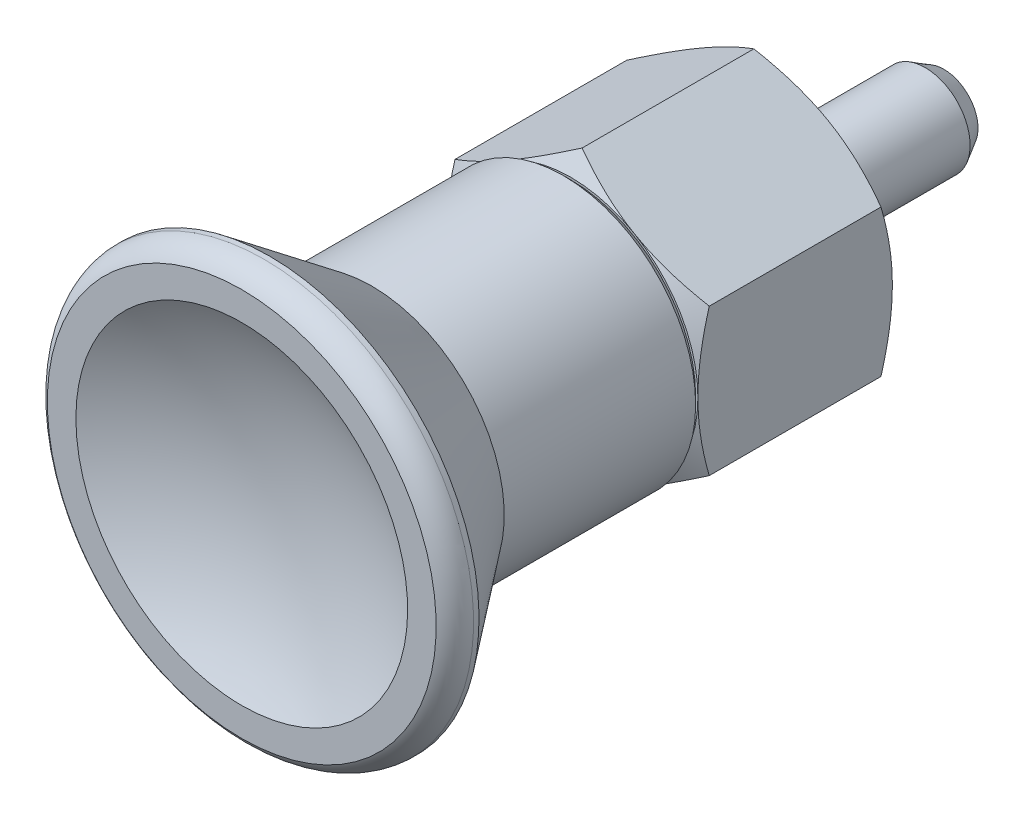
ISO-10303-21;
HEADER;
FILE_DESCRIPTION(('STEP AP214'),'2;1');
FILE_NAME('part.step','',(''),(''),'','','');
FILE_SCHEMA(('AUTOMOTIVE_DESIGN { 1 0 10303 214 1 1 1 1 }'));
ENDSEC;
DATA;
#1=APPLICATION_CONTEXT('core data for automotive mechanical design processes');
#2=APPLICATION_PROTOCOL_DEFINITION('international standard','automotive_design',2000,#1);
#3=PRODUCT_CONTEXT('',#1,'mechanical');
#4=PRODUCT('Part','Part','',(#3));
#5=PRODUCT_RELATED_PRODUCT_CATEGORY('part','',(#4));
#6=PRODUCT_DEFINITION_FORMATION('','',#4);
#7=PRODUCT_DEFINITION_CONTEXT('part definition',#1,'design');
#8=PRODUCT_DEFINITION('design','',#6,#7);
#9=PRODUCT_DEFINITION_SHAPE('','',#8);
#10=(LENGTH_UNIT() NAMED_UNIT(*) SI_UNIT(.MILLI.,.METRE.));
#11=(NAMED_UNIT(*) PLANE_ANGLE_UNIT() SI_UNIT($,.RADIAN.));
#12=(NAMED_UNIT(*) SI_UNIT($,.STERADIAN.) SOLID_ANGLE_UNIT());
#13=UNCERTAINTY_MEASURE_WITH_UNIT(LENGTH_MEASURE(1.E-05),#10,'distance_accuracy_value','');
#14=(GEOMETRIC_REPRESENTATION_CONTEXT(3) GLOBAL_UNCERTAINTY_ASSIGNED_CONTEXT((#13)) GLOBAL_UNIT_ASSIGNED_CONTEXT((#10,
#11,#12)) REPRESENTATION_CONTEXT('',''));
#15=CARTESIAN_POINT('',(0.,0.,0.));
#16=DIRECTION('',(0.,0.,1.));
#17=DIRECTION('',(1.,0.,0.));
#18=AXIS2_PLACEMENT_3D('',#15,#16,#17);
#19=CARTESIAN_POINT('',(-8.5,0.,0.));
#20=DIRECTION('',(0.,0.,1.));
#21=DIRECTION('',(0.,1.,0.));
#22=AXIS2_PLACEMENT_3D('',#19,#20,#21);
#23=PLANE('',#22);
#24=CARTESIAN_POINT('',(0.,0.,0.));
#25=DIRECTION('',(0.,0.,1.));
#26=DIRECTION('',(1.,0.,0.));
#27=AXIS2_PLACEMENT_3D('',#24,#25,#26);
#28=CIRCLE('',#27,8.5);
#29=CARTESIAN_POINT('',(-4.25,7.36121593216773,0.));
#30=VERTEX_POINT('',#29);
#31=CARTESIAN_POINT('',(-8.5,0.,0.));
#32=VERTEX_POINT('',#31);
#33=EDGE_CURVE('E489',#30,#32,#28,.T.);
#34=ORIENTED_EDGE('',*,*,#33,.F.);
#35=CARTESIAN_POINT('',(0.,0.,0.));
#36=DIRECTION('',(0.,0.,1.));
#37=DIRECTION('',(1.,0.,0.));
#38=AXIS2_PLACEMENT_3D('',#35,#36,#37);
#39=CIRCLE('',#38,8.5);
#40=CARTESIAN_POINT('',(4.25,7.36121593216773,0.));
#41=VERTEX_POINT('',#40);
#42=EDGE_CURVE('E106',#41,#30,#39,.T.);
#43=ORIENTED_EDGE('',*,*,#42,.F.);
#44=CARTESIAN_POINT('',(0.,0.,0.));
#45=DIRECTION('',(0.,0.,1.));
#46=DIRECTION('',(1.,0.,0.));
#47=AXIS2_PLACEMENT_3D('',#44,#45,#46);
#48=CIRCLE('',#47,8.5);
#49=CARTESIAN_POINT('',(8.5,0.,0.));
#50=VERTEX_POINT('',#49);
#51=EDGE_CURVE('E99',#50,#41,#48,.T.);
#52=ORIENTED_EDGE('',*,*,#51,.F.);
#53=CARTESIAN_POINT('',(0.,0.,0.));
#54=DIRECTION('',(0.,0.,1.));
#55=DIRECTION('',(0.,1.,0.));
#56=AXIS2_PLACEMENT_3D('',#53,#54,#55);
#57=CIRCLE('',#56,8.5);
#58=CARTESIAN_POINT('',(4.25,-7.36121593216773,0.));
#59=VERTEX_POINT('',#58);
#60=EDGE_CURVE('E103',#59,#50,#57,.T.);
#61=ORIENTED_EDGE('',*,*,#60,.F.);
#62=CARTESIAN_POINT('',(0.,0.,0.));
#63=DIRECTION('',(0.,0.,1.));
#64=DIRECTION('',(1.,0.,0.));
#65=AXIS2_PLACEMENT_3D('',#62,#63,#64);
#66=CIRCLE('',#65,8.5);
#67=CARTESIAN_POINT('',(-4.25,-7.36121593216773,0.));
#68=VERTEX_POINT('',#67);
#69=EDGE_CURVE('E127',#68,#59,#66,.T.);
#70=ORIENTED_EDGE('',*,*,#69,.F.);
#71=CARTESIAN_POINT('',(0.,0.,0.));
#72=DIRECTION('',(0.,0.,1.));
#73=DIRECTION('',(1.,0.,0.));
#74=AXIS2_PLACEMENT_3D('',#71,#72,#73);
#75=CIRCLE('',#74,8.5);
#76=EDGE_CURVE('E517',#32,#68,#75,.T.);
#77=ORIENTED_EDGE('',*,*,#76,.F.);
#78=EDGE_LOOP('',(#34,#43,#52,#61,#70,#77));
#79=FACE_BOUND('',#78,.T.);
#80=CARTESIAN_POINT('',(0.,0.,0.));
#81=DIRECTION('',(0.,0.,1.));
#82=DIRECTION('',(0.,1.,0.));
#83=AXIS2_PLACEMENT_3D('',#80,#81,#82);
#84=CIRCLE('',#83,5.);
#85=CARTESIAN_POINT('',(0.,5.,0.));
#86=VERTEX_POINT('',#85);
#87=EDGE_CURVE('E522',#86,#86,#84,.T.);
#88=ORIENTED_EDGE('',*,*,#87,.T.);
#89=EDGE_LOOP('',(#88));
#90=FACE_BOUND('',#89,.T.);
#91=ADVANCED_FACE('F14',(#79,#90),#23,.F.);
#92=CARTESIAN_POINT('',(0.,0.,0.763744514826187));
#93=DIRECTION('',(0.,0.,1.));
#94=DIRECTION('',(1.,0.,0.));
#95=AXIS2_PLACEMENT_3D('',#92,#93,#94);
#96=CONICAL_SURFACE('',#95,9.82284430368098,1.0471975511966);
#97=CARTESIAN_POINT('',(4.25,7.36121593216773,0.));
#98=CARTESIAN_POINT('',(4.43038865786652,7.25706849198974,-3.47391832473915E-05));
#99=CARTESIAN_POINT('',(4.61076862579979,7.15292606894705,0.00441964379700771));
#100=CARTESIAN_POINT('',(4.97117438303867,6.94484570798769,0.0220484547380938));
#101=CARTESIAN_POINT('',(5.15120023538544,6.84090773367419,0.0352211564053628));
#102=CARTESIAN_POINT('',(5.50973493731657,6.63390762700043,0.0699416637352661));
#103=CARTESIAN_POINT('',(5.6882468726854,6.53084371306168,0.0914473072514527));
#104=CARTESIAN_POINT('',(6.04442025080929,6.32520691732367,0.142371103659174));
#105=CARTESIAN_POINT('',(6.22208167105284,6.22263404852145,0.171789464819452));
#106=CARTESIAN_POINT('',(6.75305373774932,5.91607718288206,0.271004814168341));
#107=CARTESIAN_POINT('',(7.10482189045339,5.71298374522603,0.351810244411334));
#108=CARTESIAN_POINT('',(7.8053331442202,5.3085433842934,0.538168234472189));
#109=CARTESIAN_POINT('',(8.15405181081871,5.1072105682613,0.643844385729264));
#110=CARTESIAN_POINT('',(8.5,4.90747728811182,0.759189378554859));
#111=B_SPLINE_CURVE_WITH_KNOTS('',3,(#97,#98,#99,#100,#101,#102,#103,#104,#105,#106,#107,#108,
#109,#110),.UNSPECIFIED.,.F.,.F.,(4,2,2,2,2,2,4),(0.,0.624820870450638,1.24951805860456,
1.87109489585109,2.4926880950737,3.73424531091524,4.98210763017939),.UNSPECIFIED.);
#112=CARTESIAN_POINT('',(8.5,4.90747728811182,0.75918937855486));
#113=VERTEX_POINT('',#112);
#114=EDGE_CURVE('E115',#41,#113,#111,.T.);
#115=ORIENTED_EDGE('',*,*,#114,.T.);
#116=CARTESIAN_POINT('',(8.5,4.90747728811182,0.75918937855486));
#117=CARTESIAN_POINT('',(8.5,4.50801072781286,0.643844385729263));
#118=CARTESIAN_POINT('',(8.5,4.10534509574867,0.538168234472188));
#119=CARTESIAN_POINT('',(8.5,3.2964643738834,0.351810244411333));
#120=CARTESIAN_POINT('',(8.5,2.89027749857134,0.271004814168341));
#121=CARTESIAN_POINT('',(8.5,2.27716376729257,0.171789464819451));
#122=CARTESIAN_POINT('',(8.5,2.07201802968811,0.142371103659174));
#123=CARTESIAN_POINT('',(8.5,1.66074443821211,0.0914473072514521));
#124=CARTESIAN_POINT('',(8.5,1.4546166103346,0.0699416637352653));
#125=CARTESIAN_POINT('',(8.5,1.04061639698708,0.0352211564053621));
#126=CARTESIAN_POINT('',(8.5,0.832740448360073,0.0220484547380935));
#127=CARTESIAN_POINT('',(8.5,0.416579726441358,0.00441964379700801));
#128=CARTESIAN_POINT('',(8.5,0.208294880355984,-3.47391832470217E-05));
#129=CARTESIAN_POINT('',(8.5,0.,0.));
#130=B_SPLINE_CURVE_WITH_KNOTS('',3,(#116,#117,#118,#119,#120,#121,#122,#123,#124,#125,#126,
#127,#128,#129),.UNSPECIFIED.,.F.,.F.,(4,2,2,2,2,2,4),(0.,1.24786231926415,2.4894195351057,
3.1110127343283,3.73258957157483,4.35728675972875,4.98210763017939),.UNSPECIFIED.);
#131=EDGE_CURVE('E113',#113,#50,#130,.T.);
#132=ORIENTED_EDGE('',*,*,#131,.T.);
#133=ORIENTED_EDGE('',*,*,#51,.T.);
#134=EDGE_LOOP('',(#115,#132,#133));
#135=FACE_BOUND('',#134,.T.);
#136=ADVANCED_FACE('F114',(#135),#96,.T.);
#137=CARTESIAN_POINT('',(0.,0.,0.763744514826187));
#138=DIRECTION('',(0.,0.,1.));
#139=DIRECTION('',(0.,1.,0.));
#140=AXIS2_PLACEMENT_3D('',#137,#138,#139);
#141=CONICAL_SURFACE('',#140,9.82284430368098,1.0471975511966);
#142=CARTESIAN_POINT('',(8.5,-4.90747728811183,0.759189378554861));
#143=CARTESIAN_POINT('',(8.15405181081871,-5.1072105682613,0.643844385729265));
#144=CARTESIAN_POINT('',(7.8053331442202,-5.3085433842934,0.538168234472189));
#145=CARTESIAN_POINT('',(7.10482189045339,-5.71298374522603,0.351810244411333));
#146=CARTESIAN_POINT('',(6.75305373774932,-5.91607718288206,0.271004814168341));
#147=CARTESIAN_POINT('',(6.22208167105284,-6.22263404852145,0.171789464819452));
#148=CARTESIAN_POINT('',(6.04442025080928,-6.32520691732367,0.142371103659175));
#149=CARTESIAN_POINT('',(5.6882468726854,-6.53084371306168,0.0914473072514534));
#150=CARTESIAN_POINT('',(5.50973493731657,-6.63390762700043,0.0699416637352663));
#151=CARTESIAN_POINT('',(5.15120023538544,-6.84090773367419,0.0352211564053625));
#152=CARTESIAN_POINT('',(4.97117438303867,-6.94484570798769,0.0220484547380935));
#153=CARTESIAN_POINT('',(4.61076862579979,-7.15292606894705,0.004419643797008));
#154=CARTESIAN_POINT('',(4.43038865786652,-7.25706849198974,-3.4739183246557E-05));
#155=CARTESIAN_POINT('',(4.25,-7.36121593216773,0.));
#156=B_SPLINE_CURVE_WITH_KNOTS('',3,(#142,#143,#144,#145,#146,#147,#148,#149,#150,#151,#152,
#153,#154,#155),.UNSPECIFIED.,.F.,.F.,(4,2,2,2,2,2,4),(0.,1.24786231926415,2.48941953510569,
3.1110127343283,3.73258957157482,4.35728675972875,4.98210763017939),.UNSPECIFIED.);
#157=CARTESIAN_POINT('',(8.5,-4.90747728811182,0.759189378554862));
#158=VERTEX_POINT('',#157);
#159=EDGE_CURVE('E125',#158,#59,#156,.T.);
#160=ORIENTED_EDGE('',*,*,#159,.T.);
#161=ORIENTED_EDGE('',*,*,#60,.T.);
#162=CARTESIAN_POINT('',(8.5,0.,0.));
#163=CARTESIAN_POINT('',(8.5,-0.208294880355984,-3.47391832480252E-05));
#164=CARTESIAN_POINT('',(8.5,-0.416579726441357,0.00441964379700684));
#165=CARTESIAN_POINT('',(8.5,-0.832740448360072,0.0220484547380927));
#166=CARTESIAN_POINT('',(8.5,-1.04061639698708,0.0352211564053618));
#167=CARTESIAN_POINT('',(8.5,-1.4546166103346,0.0699416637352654));
#168=CARTESIAN_POINT('',(8.5,-1.66074443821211,0.0914473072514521));
#169=CARTESIAN_POINT('',(8.5,-2.07201802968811,0.142371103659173));
#170=CARTESIAN_POINT('',(8.5,-2.27716376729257,0.171789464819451));
#171=CARTESIAN_POINT('',(8.5,-2.89027749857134,0.271004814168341));
#172=CARTESIAN_POINT('',(8.5,-3.2964643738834,0.351810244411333));
#173=CARTESIAN_POINT('',(8.5,-4.10534509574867,0.538168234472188));
#174=CARTESIAN_POINT('',(8.5,-4.50801072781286,0.643844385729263));
#175=CARTESIAN_POINT('',(8.5,-4.90747728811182,0.75918937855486));
#176=B_SPLINE_CURVE_WITH_KNOTS('',3,(#162,#163,#164,#165,#166,#167,#168,#169,#170,#171,#172,
#173,#174,#175),.UNSPECIFIED.,.F.,.F.,(4,2,2,2,2,2,4),(0.,0.624820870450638,1.24951805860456,
1.87109489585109,2.4926880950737,3.73424531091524,4.98210763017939),.UNSPECIFIED.);
#177=EDGE_CURVE('E119',#50,#158,#176,.T.);
#178=ORIENTED_EDGE('',*,*,#177,.T.);
#179=EDGE_LOOP('',(#160,#161,#178));
#180=FACE_BOUND('',#179,.T.);
#181=ADVANCED_FACE('F122',(#180),#141,.T.);
#182=CARTESIAN_POINT('',(0.,0.,0.763744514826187));
#183=DIRECTION('',(0.,0.,1.));
#184=DIRECTION('',(1.,0.,0.));
#185=AXIS2_PLACEMENT_3D('',#182,#183,#184);
#186=CONICAL_SURFACE('',#185,9.82284430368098,1.0471975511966);
#187=CARTESIAN_POINT('',(4.25,-7.36121593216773,0.));
#188=CARTESIAN_POINT('',(4.06961134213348,-7.46536337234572,-3.47391832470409E-05));
#189=CARTESIAN_POINT('',(3.88923137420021,-7.56950579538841,0.00441964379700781));
#190=CARTESIAN_POINT('',(3.52882561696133,-7.77758615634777,0.0220484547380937));
#191=CARTESIAN_POINT('',(3.34879976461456,-7.88152413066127,0.0352211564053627));
#192=CARTESIAN_POINT('',(2.99026506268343,-8.08852423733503,0.069941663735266));
#193=CARTESIAN_POINT('',(2.8117531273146,-8.19158815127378,0.0914473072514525));
#194=CARTESIAN_POINT('',(2.45557974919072,-8.39722494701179,0.142371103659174));
#195=CARTESIAN_POINT('',(2.27791832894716,-8.49979781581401,0.171789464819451));
#196=CARTESIAN_POINT('',(1.74694626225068,-8.8063546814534,0.271004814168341));
#197=CARTESIAN_POINT('',(1.39517810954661,-9.00944811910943,0.351810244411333));
#198=CARTESIAN_POINT('',(0.694666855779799,-9.41388848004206,0.538168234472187));
#199=CARTESIAN_POINT('',(0.345948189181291,-9.61522129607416,0.643844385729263));
#200=CARTESIAN_POINT('',(0.,-9.81495457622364,0.75918937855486));
#201=B_SPLINE_CURVE_WITH_KNOTS('',3,(#187,#188,#189,#190,#191,#192,#193,#194,#195,#196,#197,
#198,#199,#200),.UNSPECIFIED.,.F.,.F.,(4,2,2,2,2,2,4),(0.,0.624820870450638,1.24951805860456,
1.87109489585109,2.49268809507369,3.73424531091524,4.98210763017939),.UNSPECIFIED.);
#202=CARTESIAN_POINT('',(0.,-9.81495457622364,0.75918937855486));
#203=VERTEX_POINT('',#202);
#204=EDGE_CURVE('E330',#59,#203,#201,.T.);
#205=ORIENTED_EDGE('',*,*,#204,.T.);
#206=CARTESIAN_POINT('',(0.,-9.81495457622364,0.759189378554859));
#207=CARTESIAN_POINT('',(-0.345948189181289,-9.61522129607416,0.643844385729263));
#208=CARTESIAN_POINT('',(-0.694666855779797,-9.41388848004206,0.538168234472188));
#209=CARTESIAN_POINT('',(-1.39517810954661,-9.00944811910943,0.351810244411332));
#210=CARTESIAN_POINT('',(-1.74694626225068,-8.8063546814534,0.27100481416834));
#211=CARTESIAN_POINT('',(-2.27791832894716,-8.49979781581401,0.171789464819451));
#212=CARTESIAN_POINT('',(-2.45557974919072,-8.39722494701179,0.142371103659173));
#213=CARTESIAN_POINT('',(-2.8117531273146,-8.19158815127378,0.0914473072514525));
#214=CARTESIAN_POINT('',(-2.99026506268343,-8.08852423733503,0.0699416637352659));
#215=CARTESIAN_POINT('',(-3.34879976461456,-7.88152413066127,0.0352211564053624));
#216=CARTESIAN_POINT('',(-3.52882561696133,-7.77758615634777,0.0220484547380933));
#217=CARTESIAN_POINT('',(-3.88923137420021,-7.56950579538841,0.00441964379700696));
#218=CARTESIAN_POINT('',(-4.06961134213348,-7.46536337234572,-3.47391832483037E-05));
#219=CARTESIAN_POINT('',(-4.25,-7.36121593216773,0.));
#220=B_SPLINE_CURVE_WITH_KNOTS('',3,(#206,#207,#208,#209,#210,#211,#212,#213,#214,#215,#216,
#217,#218,#219),.UNSPECIFIED.,.F.,.F.,(4,2,2,2,2,2,4),(0.,1.24786231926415,2.48941953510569,
3.1110127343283,3.73258957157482,4.35728675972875,4.98210763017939),.UNSPECIFIED.);
#221=EDGE_CURVE('E324',#203,#68,#220,.T.);
#222=ORIENTED_EDGE('',*,*,#221,.T.);
#223=ORIENTED_EDGE('',*,*,#69,.T.);
#224=EDGE_LOOP('',(#205,#222,#223));
#225=FACE_BOUND('',#224,.T.);
#226=ADVANCED_FACE('F159',(#225),#186,.T.);
#227=CARTESIAN_POINT('',(0.,0.,0.763744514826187));
#228=DIRECTION('',(0.,0.,1.));
#229=DIRECTION('',(1.,0.,0.));
#230=AXIS2_PLACEMENT_3D('',#227,#228,#229);
#231=CONICAL_SURFACE('',#230,9.82284430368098,1.0471975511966);
#232=CARTESIAN_POINT('',(-4.25,7.36121593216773,0.));
#233=CARTESIAN_POINT('',(-4.06961134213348,7.46536337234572,-3.47391832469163E-05));
#234=CARTESIAN_POINT('',(-3.88923137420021,7.56950579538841,0.00441964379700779));
#235=CARTESIAN_POINT('',(-3.52882561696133,7.77758615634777,0.0220484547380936));
#236=CARTESIAN_POINT('',(-3.34879976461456,7.88152413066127,0.0352211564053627));
#237=CARTESIAN_POINT('',(-2.99026506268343,8.08852423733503,0.0699416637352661));
#238=CARTESIAN_POINT('',(-2.8117531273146,8.19158815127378,0.0914473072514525));
#239=CARTESIAN_POINT('',(-2.45557974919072,8.39722494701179,0.142371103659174));
#240=CARTESIAN_POINT('',(-2.27791832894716,8.49979781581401,0.171789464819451));
#241=CARTESIAN_POINT('',(-1.74694626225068,8.8063546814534,0.271004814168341));
#242=CARTESIAN_POINT('',(-1.39517810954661,9.00944811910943,0.351810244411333));
#243=CARTESIAN_POINT('',(-0.694666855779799,9.41388848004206,0.538168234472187));
#244=CARTESIAN_POINT('',(-0.345948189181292,9.61522129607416,0.643844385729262));
#245=CARTESIAN_POINT('',(0.,9.81495457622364,0.75918937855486));
#246=B_SPLINE_CURVE_WITH_KNOTS('',3,(#232,#233,#234,#235,#236,#237,#238,#239,#240,#241,#242,
#243,#244,#245),.UNSPECIFIED.,.F.,.F.,(4,2,2,2,2,2,4),(0.,0.624820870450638,1.24951805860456,
1.87109489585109,2.49268809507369,3.73424531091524,4.98210763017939),.UNSPECIFIED.);
#247=CARTESIAN_POINT('',(0.,9.81495457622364,0.759189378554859));
#248=VERTEX_POINT('',#247);
#249=EDGE_CURVE('E445',#30,#248,#246,.T.);
#250=ORIENTED_EDGE('',*,*,#249,.T.);
#251=CARTESIAN_POINT('',(0.,9.81495457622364,0.759189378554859));
#252=CARTESIAN_POINT('',(0.345948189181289,9.61522129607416,0.643844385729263));
#253=CARTESIAN_POINT('',(0.694666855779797,9.41388848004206,0.538168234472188));
#254=CARTESIAN_POINT('',(1.39517810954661,9.00944811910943,0.351810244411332));
#255=CARTESIAN_POINT('',(1.74694626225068,8.8063546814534,0.27100481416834));
#256=CARTESIAN_POINT('',(2.27791832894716,8.49979781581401,0.171789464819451));
#257=CARTESIAN_POINT('',(2.45557974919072,8.39722494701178,0.142371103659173));
#258=CARTESIAN_POINT('',(2.8117531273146,8.19158815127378,0.0914473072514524));
#259=CARTESIAN_POINT('',(2.99026506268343,8.08852423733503,0.0699416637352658));
#260=CARTESIAN_POINT('',(3.34879976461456,7.88152413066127,0.0352211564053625));
#261=CARTESIAN_POINT('',(3.52882561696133,7.77758615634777,0.0220484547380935));
#262=CARTESIAN_POINT('',(3.88923137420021,7.56950579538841,0.00441964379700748));
#263=CARTESIAN_POINT('',(4.06961134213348,7.46536337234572,-3.47391832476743E-05));
#264=CARTESIAN_POINT('',(4.25,7.36121593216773,0.));
#265=B_SPLINE_CURVE_WITH_KNOTS('',3,(#251,#252,#253,#254,#255,#256,#257,#258,#259,#260,#261,
#262,#263,#264),.UNSPECIFIED.,.F.,.F.,(4,2,2,2,2,2,4),(0.,1.24786231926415,2.48941953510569,
3.1110127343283,3.73258957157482,4.35728675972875,4.98210763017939),.UNSPECIFIED.);
#266=EDGE_CURVE('E173',#248,#41,#265,.T.);
#267=ORIENTED_EDGE('',*,*,#266,.T.);
#268=ORIENTED_EDGE('',*,*,#42,.T.);
#269=EDGE_LOOP('',(#250,#267,#268));
#270=FACE_BOUND('',#269,.T.);
#271=ADVANCED_FACE('F467',(#270),#231,.T.);
#272=CARTESIAN_POINT('',(0.,0.,0.763744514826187));
#273=DIRECTION('',(0.,0.,1.));
#274=DIRECTION('',(1.,0.,0.));
#275=AXIS2_PLACEMENT_3D('',#272,#273,#274);
#276=CONICAL_SURFACE('',#275,9.82284430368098,1.0471975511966);
#277=CARTESIAN_POINT('',(-4.25,-7.36121593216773,0.));
#278=CARTESIAN_POINT('',(-4.43038865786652,-7.25706849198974,-3.47391832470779E-05));
#279=CARTESIAN_POINT('',(-4.61076862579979,-7.15292606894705,0.00441964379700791));
#280=CARTESIAN_POINT('',(-4.97117438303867,-6.94484570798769,0.0220484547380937));
#281=CARTESIAN_POINT('',(-5.15120023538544,-6.84090773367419,0.0352211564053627));
#282=CARTESIAN_POINT('',(-5.50973493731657,-6.63390762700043,0.0699416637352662));
#283=CARTESIAN_POINT('',(-5.6882468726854,-6.53084371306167,0.091447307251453));
#284=CARTESIAN_POINT('',(-6.04442025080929,-6.32520691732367,0.142371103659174));
#285=CARTESIAN_POINT('',(-6.22208167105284,-6.22263404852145,0.171789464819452));
#286=CARTESIAN_POINT('',(-6.75305373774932,-5.91607718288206,0.271004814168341));
#287=CARTESIAN_POINT('',(-7.10482189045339,-5.71298374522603,0.351810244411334));
#288=CARTESIAN_POINT('',(-7.8053331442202,-5.3085433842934,0.538168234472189));
#289=CARTESIAN_POINT('',(-8.15405181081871,-5.1072105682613,0.643844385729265));
#290=CARTESIAN_POINT('',(-8.5,-4.90747728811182,0.75918937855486));
#291=B_SPLINE_CURVE_WITH_KNOTS('',3,(#277,#278,#279,#280,#281,#282,#283,#284,#285,#286,#287,
#288,#289,#290),.UNSPECIFIED.,.F.,.F.,(4,2,2,2,2,2,4),(0.,0.624820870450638,1.24951805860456,
1.87109489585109,2.4926880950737,3.73424531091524,4.98210763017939),.UNSPECIFIED.);
#292=CARTESIAN_POINT('',(-8.5,-4.90747728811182,0.75918937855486));
#293=VERTEX_POINT('',#292);
#294=EDGE_CURVE('E315',#68,#293,#291,.T.);
#295=ORIENTED_EDGE('',*,*,#294,.T.);
#296=CARTESIAN_POINT('',(-8.5,-4.90747728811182,0.75918937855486));
#297=CARTESIAN_POINT('',(-8.5,-4.50801072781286,0.643844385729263));
#298=CARTESIAN_POINT('',(-8.5,-4.10534509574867,0.538168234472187));
#299=CARTESIAN_POINT('',(-8.5,-3.2964643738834,0.351810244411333));
#300=CARTESIAN_POINT('',(-8.5,-2.89027749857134,0.271004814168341));
#301=CARTESIAN_POINT('',(-8.5,-2.27716376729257,0.171789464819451));
#302=CARTESIAN_POINT('',(-8.5,-2.07201802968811,0.142371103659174));
#303=CARTESIAN_POINT('',(-8.5,-1.66074443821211,0.0914473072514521));
#304=CARTESIAN_POINT('',(-8.5,-1.4546166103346,0.0699416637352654));
#305=CARTESIAN_POINT('',(-8.5,-1.04061639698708,0.0352211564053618));
#306=CARTESIAN_POINT('',(-8.5,-0.832740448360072,0.0220484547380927));
#307=CARTESIAN_POINT('',(-8.5,-0.416579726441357,0.00441964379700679));
#308=CARTESIAN_POINT('',(-8.5,-0.208294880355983,-3.47391832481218E-05));
#309=CARTESIAN_POINT('',(-8.5,0.,0.));
#310=B_SPLINE_CURVE_WITH_KNOTS('',3,(#296,#297,#298,#299,#300,#301,#302,#303,#304,#305,#306,
#307,#308,#309),.UNSPECIFIED.,.F.,.F.,(4,2,2,2,2,2,4),(0.,1.24786231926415,2.4894195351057,
3.1110127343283,3.73258957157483,4.35728675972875,4.98210763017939),.UNSPECIFIED.);
#311=EDGE_CURVE('E444',#293,#32,#310,.T.);
#312=ORIENTED_EDGE('',*,*,#311,.T.);
#313=ORIENTED_EDGE('',*,*,#76,.T.);
#314=EDGE_LOOP('',(#295,#312,#313));
#315=FACE_BOUND('',#314,.T.);
#316=ADVANCED_FACE('F470',(#315),#276,.T.);
#317=CARTESIAN_POINT('',(0.,0.,0.763744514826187));
#318=DIRECTION('',(0.,0.,1.));
#319=DIRECTION('',(1.,0.,0.));
#320=AXIS2_PLACEMENT_3D('',#317,#318,#319);
#321=CONICAL_SURFACE('',#320,9.82284430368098,1.0471975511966);
#322=CARTESIAN_POINT('',(-8.5,0.,0.));
#323=CARTESIAN_POINT('',(-8.5,0.208294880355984,-3.47391832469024E-05));
#324=CARTESIAN_POINT('',(-8.5,0.416579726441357,0.00441964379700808));
#325=CARTESIAN_POINT('',(-8.5,0.832740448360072,0.0220484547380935));
#326=CARTESIAN_POINT('',(-8.5,1.04061639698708,0.035221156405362));
#327=CARTESIAN_POINT('',(-8.5,1.4546166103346,0.0699416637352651));
#328=CARTESIAN_POINT('',(-8.5,1.66074443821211,0.091447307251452));
#329=CARTESIAN_POINT('',(-8.5,2.07201802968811,0.142371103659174));
#330=CARTESIAN_POINT('',(-8.5,2.27716376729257,0.171789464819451));
#331=CARTESIAN_POINT('',(-8.5,2.89027749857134,0.271004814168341));
#332=CARTESIAN_POINT('',(-8.5,3.2964643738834,0.351810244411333));
#333=CARTESIAN_POINT('',(-8.5,4.10534509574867,0.538168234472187));
#334=CARTESIAN_POINT('',(-8.5,4.50801072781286,0.643844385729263));
#335=CARTESIAN_POINT('',(-8.5,4.90747728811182,0.75918937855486));
#336=B_SPLINE_CURVE_WITH_KNOTS('',3,(#322,#323,#324,#325,#326,#327,#328,#329,#330,#331,#332,
#333,#334,#335),.UNSPECIFIED.,.F.,.F.,(4,2,2,2,2,2,4),(0.,0.624820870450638,1.24951805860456,
1.87109489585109,2.4926880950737,3.73424531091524,4.98210763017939),.UNSPECIFIED.);
#337=CARTESIAN_POINT('',(-8.5,4.90747728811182,0.759189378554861));
#338=VERTEX_POINT('',#337);
#339=EDGE_CURVE('E243',#32,#338,#336,.T.);
#340=ORIENTED_EDGE('',*,*,#339,.T.);
#341=CARTESIAN_POINT('',(-8.5,4.90747728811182,0.759189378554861));
#342=CARTESIAN_POINT('',(-8.15405181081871,5.1072105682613,0.643844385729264));
#343=CARTESIAN_POINT('',(-7.8053331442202,5.3085433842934,0.538168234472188));
#344=CARTESIAN_POINT('',(-7.10482189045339,5.71298374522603,0.351810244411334));
#345=CARTESIAN_POINT('',(-6.75305373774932,5.91607718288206,0.271004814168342));
#346=CARTESIAN_POINT('',(-6.22208167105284,6.22263404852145,0.171789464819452));
#347=CARTESIAN_POINT('',(-6.04442025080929,6.32520691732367,0.142371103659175));
#348=CARTESIAN_POINT('',(-5.6882468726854,6.53084371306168,0.0914473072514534));
#349=CARTESIAN_POINT('',(-5.50973493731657,6.63390762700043,0.0699416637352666));
#350=CARTESIAN_POINT('',(-5.15120023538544,6.84090773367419,0.0352211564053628));
#351=CARTESIAN_POINT('',(-4.97117438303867,6.94484570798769,0.0220484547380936));
#352=CARTESIAN_POINT('',(-4.61076862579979,7.15292606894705,0.00441964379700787));
#353=CARTESIAN_POINT('',(-4.43038865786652,7.25706849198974,-3.47391832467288E-05));
#354=CARTESIAN_POINT('',(-4.25,7.36121593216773,0.));
#355=B_SPLINE_CURVE_WITH_KNOTS('',3,(#341,#342,#343,#344,#345,#346,#347,#348,#349,#350,#351,
#352,#353,#354),.UNSPECIFIED.,.F.,.F.,(4,2,2,2,2,2,4),(0.,1.24786231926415,2.48941953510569,
3.1110127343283,3.73258957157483,4.35728675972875,4.98210763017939),.UNSPECIFIED.);
#356=EDGE_CURVE('E450',#338,#30,#355,.T.);
#357=ORIENTED_EDGE('',*,*,#356,.T.);
#358=ORIENTED_EDGE('',*,*,#33,.T.);
#359=EDGE_LOOP('',(#340,#357,#358));
#360=FACE_BOUND('',#359,.T.);
#361=ADVANCED_FACE('F474',(#360),#321,.T.);
#362=CARTESIAN_POINT('',(0.,0.,54.));
#363=DIRECTION('',(1.,0.,0.));
#364=DIRECTION('',(0.,-1.,0.));
#365=AXIS2_PLACEMENT_3D('',#362,#363,#364);
#366=SPHERICAL_SURFACE('',#365,22.);
#367=CARTESIAN_POINT('',(0.,-11.0905365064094,35.));
#368=CARTESIAN_POINT('',(0.311592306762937,-11.0905387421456,35.));
#369=CARTESIAN_POINT('',(0.623147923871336,-11.0773996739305,35.));
#370=CARTESIAN_POINT('',(1.2441486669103,-11.0249351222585,35.));
#371=CARTESIAN_POINT('',(1.55359321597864,-10.9856027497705,35.));
#372=CARTESIAN_POINT('',(2.16839724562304,-10.8809650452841,35.));
#373=CARTESIAN_POINT('',(2.47375196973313,-10.8156317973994,35.));
#374=CARTESIAN_POINT('',(3.07786779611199,-10.6594588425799,35.));
#375=CARTESIAN_POINT('',(3.37662892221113,-10.5686192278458,35.));
#376=CARTESIAN_POINT('',(3.96528771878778,-10.3621299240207,35.));
#377=CARTESIAN_POINT('',(4.25518961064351,-10.2464922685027,35.));
#378=CARTESIAN_POINT('',(4.82422457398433,-9.99120122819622,35.));
#379=CARTESIAN_POINT('',(5.10335747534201,-9.85154746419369,35.));
#380=CARTESIAN_POINT('',(5.64879485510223,-9.54925716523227,35.));
#381=CARTESIAN_POINT('',(5.9151025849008,-9.38662649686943,35.));
#382=CARTESIAN_POINT('',(6.4330719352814,-9.03951216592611,35.));
#383=CARTESIAN_POINT('',(6.68473361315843,-8.85502858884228,35.));
#384=CARTESIAN_POINT('',(7.17164914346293,-8.46549844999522,35.));
#385=CARTESIAN_POINT('',(7.40690124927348,-8.26044970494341,35.));
#386=CARTESIAN_POINT('',(7.85929603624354,-7.83126308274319,35.));
#387=CARTESIAN_POINT('',(8.07643869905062,-7.60712518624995,35.));
#388=CARTESIAN_POINT('',(8.49107872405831,-7.14134478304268,35.));
#389=CARTESIAN_POINT('',(8.68857532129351,-6.89970159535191,35.));
#390=CARTESIAN_POINT('',(9.06250942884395,-6.40063637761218,35.));
#391=CARTESIAN_POINT('',(9.23894694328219,-6.14321435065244,35.));
#392=CARTESIAN_POINT('',(9.56950544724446,-5.61442651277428,35.));
#393=CARTESIAN_POINT('',(9.72362685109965,-5.34306096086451,35.));
#394=CARTESIAN_POINT('',(10.008461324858,-4.78831092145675,35.));
#395=CARTESIAN_POINT('',(10.1391743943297,-4.5049264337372,35.));
#396=CARTESIAN_POINT('',(10.3762626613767,-3.92815381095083,35.));
#397=CARTESIAN_POINT('',(10.4826379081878,-3.6347656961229,35.));
#398=CARTESIAN_POINT('',(10.6702946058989,-3.04007108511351,35.));
#399=CARTESIAN_POINT('',(10.7515760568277,-2.73876458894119,35.));
#400=CARTESIAN_POINT('',(10.8884674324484,-2.13037473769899,35.));
#401=CARTESIAN_POINT('',(10.9440773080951,-1.82329137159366,35.));
#402=CARTESIAN_POINT('',(11.0292299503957,-1.20553152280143,35.));
#403=CARTESIAN_POINT('',(11.0587727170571,-0.894855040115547,35.));
#404=CARTESIAN_POINT('',(11.0915810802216,-0.272118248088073,35.));
#405=CARTESIAN_POINT('',(11.0948467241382,0.039942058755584,35.));
#406=CARTESIAN_POINT('',(11.0750777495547,0.66322849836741,35.));
#407=CARTESIAN_POINT('',(11.0520431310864,0.974454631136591,35.));
#408=CARTESIAN_POINT('',(10.9798373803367,1.5938602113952,35.));
#409=CARTESIAN_POINT('',(10.9306662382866,1.90203965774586,35.));
#410=CARTESIAN_POINT('',(10.8065370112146,2.51316077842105,35.));
#411=CARTESIAN_POINT('',(10.7315789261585,2.81610245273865,35.));
#412=CARTESIAN_POINT('',(10.5564086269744,3.41459461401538,35.));
#413=CARTESIAN_POINT('',(10.4561963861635,3.71014509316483,35.));
#414=CARTESIAN_POINT('',(10.2312302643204,4.2917533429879,35.));
#415=CARTESIAN_POINT('',(10.1064763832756,4.57781111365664,35.));
#416=CARTESIAN_POINT('',(9.83331395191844,5.13840015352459,35.));
#417=CARTESIAN_POINT('',(9.68490540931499,5.41293142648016,35.));
#418=CARTESIAN_POINT('',(9.36548872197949,5.94851581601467,35.));
#419=CARTESIAN_POINT('',(9.19448057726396,6.20956893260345,35.));
#420=CARTESIAN_POINT('',(8.83108052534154,6.71634097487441,35.));
#421=CARTESIAN_POINT('',(8.63868862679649,6.96205990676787,35.));
#422=CARTESIAN_POINT('',(8.2338888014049,7.43641678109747,35.));
#423=CARTESIAN_POINT('',(8.02148087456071,7.66505472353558,35.));
#424=CARTESIAN_POINT('',(7.57815905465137,8.10362417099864,35.));
#425=CARTESIAN_POINT('',(7.34724515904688,8.3135556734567,35.));
#426=CARTESIAN_POINT('',(6.86855308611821,8.7132197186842,35.));
#427=CARTESIAN_POINT('',(6.62077490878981,8.90295226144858,35.));
#428=CARTESIAN_POINT('',(6.11011579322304,9.26086952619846,35.));
#429=CARTESIAN_POINT('',(5.84723485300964,9.4290542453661,35.));
#430=CARTESIAN_POINT('',(5.30823916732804,9.7426801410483,35.));
#431=CARTESIAN_POINT('',(5.03212442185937,9.88812131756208,35.));
#432=CARTESIAN_POINT('',(4.46862414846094,10.1552261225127,35.));
#433=CARTESIAN_POINT('',(4.18123862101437,10.276889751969,35.));
#434=CARTESIAN_POINT('',(3.59723991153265,10.4955745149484,35.));
#435=CARTESIAN_POINT('',(3.30062672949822,10.5925956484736,35.));
#436=CARTESIAN_POINT('',(2.70028146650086,10.7613056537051,35.));
#437=CARTESIAN_POINT('',(2.39654938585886,10.8329945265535,35.));
#438=CARTESIAN_POINT('',(1.78412566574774,10.9505303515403,35.));
#439=CARTESIAN_POINT('',(1.47543402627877,10.9963773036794,35.));
#440=CARTESIAN_POINT('',(0.855285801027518,11.0619033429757,35.));
#441=CARTESIAN_POINT('',(0.543829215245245,11.0815824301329,35.));
#442=CARTESIAN_POINT('',(-0.0796346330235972,11.0946328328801,35.));
#443=CARTESIAN_POINT('',(-0.391641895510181,11.0880041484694,35.));
#444=CARTESIAN_POINT('',(-1.01398892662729,11.0484861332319,35.));
#445=CARTESIAN_POINT('',(-1.32432869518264,11.0155968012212,35.));
#446=CARTESIAN_POINT('',(-1.94113439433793,10.9237913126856,35.));
#447=CARTESIAN_POINT('',(-2.24760032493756,10.8648751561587,35.));
#448=CARTESIAN_POINT('',(-2.85447957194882,10.7214348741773,35.));
#449=CARTESIAN_POINT('',(-3.15489288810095,10.6369107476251,35.));
#450=CARTESIAN_POINT('',(-3.74753113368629,10.4428554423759,35.));
#451=CARTESIAN_POINT('',(-4.03975606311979,10.3333242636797,35.));
#452=CARTESIAN_POINT('',(-4.61393995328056,10.0900335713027,35.));
#453=CARTESIAN_POINT('',(-4.89589891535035,9.95627406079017,35.));
#454=CARTESIAN_POINT('',(-5.44754635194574,9.66547764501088,35.));
#455=CARTESIAN_POINT('',(-5.71723482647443,9.50844073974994,35.));
#456=CARTESIAN_POINT('',(-6.24242392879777,9.17220599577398,35.));
#457=CARTESIAN_POINT('',(-6.49792455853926,8.99300816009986,35.));
#458=CARTESIAN_POINT('',(-6.99292155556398,8.61372552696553,35.));
#459=CARTESIAN_POINT('',(-7.23241792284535,8.41364072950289,35.));
#460=CARTESIAN_POINT('',(-7.69370381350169,7.99400657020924,35.));
#461=CARTESIAN_POINT('',(-7.91549332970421,7.77445720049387,35.));
#462=CARTESIAN_POINT('',(-8.33978861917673,7.31745483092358,35.));
#463=CARTESIAN_POINT('',(-8.54229439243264,7.08000183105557,35.));
#464=CARTESIAN_POINT('',(-8.92658256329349,6.58888027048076,35.));
#465=CARTESIAN_POINT('',(-9.10836495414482,6.33521170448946,35.));
#466=CARTESIAN_POINT('',(-9.44991391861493,5.81346251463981,35.));
#467=CARTESIAN_POINT('',(-9.60968049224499,5.54538189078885,35.));
#468=CARTESIAN_POINT('',(-9.90606181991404,4.99671476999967,35.));
#469=CARTESIAN_POINT('',(-10.0426765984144,4.71612828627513,35.));
#470=CARTESIAN_POINT('',(-10.2917832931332,4.14444398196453,35.));
#471=CARTESIAN_POINT('',(-10.4042752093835,3.85334616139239,35.));
#472=CARTESIAN_POINT('',(-10.6043363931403,3.26270882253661,35.));
#473=CARTESIAN_POINT('',(-10.6919056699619,2.96316930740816,35.));
#474=CARTESIAN_POINT('',(-10.8414990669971,2.35777801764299,35.));
#475=CARTESIAN_POINT('',(-10.9035231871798,2.05192624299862,35.));
#476=CARTESIAN_POINT('',(-11.0015854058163,1.43608429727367,35.));
#477=CARTESIAN_POINT('',(-11.0376234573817,1.12609411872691,35.));
#478=CARTESIAN_POINT('',(-11.083457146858,0.504179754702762,35.));
#479=CARTESIAN_POINT('',(-11.0932527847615,0.192255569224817,35.));
#480=CARTESIAN_POINT('',(-11.0865320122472,-0.431308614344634,35.));
#481=CARTESIAN_POINT('',(-11.0700156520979,-0.742948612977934,35.));
#482=CARTESIAN_POINT('',(-11.0107883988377,-1.36372945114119,35.));
#483=CARTESIAN_POINT('',(-10.9680775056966,-1.67287029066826,35.));
#484=CARTESIAN_POINT('',(-10.8567647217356,-2.2864556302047,35.));
#485=CARTESIAN_POINT('',(-10.7881627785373,-2.59090012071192,35.));
#486=CARTESIAN_POINT('',(-10.6255556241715,-3.19292769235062,35.));
#487=CARTESIAN_POINT('',(-10.5315504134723,-3.49051077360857,35.));
#488=CARTESIAN_POINT('',(-10.3188030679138,-4.07670533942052,35.));
#489=CARTESIAN_POINT('',(-10.2000604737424,-4.36531665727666,35.));
#490=CARTESIAN_POINT('',(-9.93868361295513,-4.93151003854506,35.));
#491=CARTESIAN_POINT('',(-9.79604934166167,-5.20909209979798,35.));
#492=CARTESIAN_POINT('',(-9.4879092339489,-5.75124282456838,35.));
#493=CARTESIAN_POINT('',(-9.32240428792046,-6.01581199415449,35.));
#494=CARTESIAN_POINT('',(-8.96969537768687,-6.53006740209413,35.));
#495=CARTESIAN_POINT('',(-8.78249143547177,-6.77975365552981,35.));
#496=CARTESIAN_POINT('',(-8.3877362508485,-7.26244279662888,35.));
#497=CARTESIAN_POINT('',(-8.18018717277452,-7.49544745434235,35.));
#498=CARTESIAN_POINT('',(-7.7461994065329,-7.94314738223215,35.));
#499=CARTESIAN_POINT('',(-7.51976064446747,-8.15784258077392,35.));
#500=CARTESIAN_POINT('',(-7.04954360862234,-8.56744885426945,35.));
#501=CARTESIAN_POINT('',(-6.80576092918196,-8.7623548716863,35.));
#502=CARTESIAN_POINT('',(-6.30264499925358,-9.13093141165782,35.));
#503=CARTESIAN_POINT('',(-6.04331199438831,-9.30460226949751,35.));
#504=CARTESIAN_POINT('',(-5.51080647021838,-9.62955592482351,35.));
#505=CARTESIAN_POINT('',(-5.23762730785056,-9.78082783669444,35.));
#506=CARTESIAN_POINT('',(-4.6794904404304,-10.0598066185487,35.));
#507=CARTESIAN_POINT('',(-4.39453269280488,-10.1875134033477,35.));
#508=CARTESIAN_POINT('',(-3.81517326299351,-10.4183286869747,35.));
#509=CARTESIAN_POINT('',(-3.5207820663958,-10.5214634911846,35.));
#510=CARTESIAN_POINT('',(-2.92445906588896,-10.7025527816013,35.));
#511=CARTESIAN_POINT('',(-2.62252926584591,-10.7805138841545,35.));
#512=CARTESIAN_POINT('',(-1.93727604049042,-10.9269540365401,35.));
#513=CARTESIAN_POINT('',(-1.55239554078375,-10.9882454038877,35.));
#514=CARTESIAN_POINT('',(-0.778324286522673,-11.0700352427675,35.));
#515=CARTESIAN_POINT('',(-0.389133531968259,-11.0905337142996,35.));
#516=CARTESIAN_POINT('',(0.,-11.0905365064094,35.));
#517=B_SPLINE_CURVE_WITH_KNOTS('',3,(#367,#368,#369,#370,#371,#372,#373,#374,#375,#376,#377,
#378,#379,#380,#381,#382,#383,#384,#385,#386,#387,#388,#389,#390,#391,#392,#393,#394,#395,#396,
#397,#398,#399,#400,#401,#402,#403,#404,#405,#406,#407,#408,#409,#410,#411,#412,#413,#414,#415,
#416,#417,#418,#419,#420,#421,#422,#423,#424,#425,#426,#427,#428,#429,#430,#431,#432,#433,#434,
#435,#436,#437,#438,#439,#440,#441,#442,#443,#444,#445,#446,#447,#448,#449,#450,#451,#452,#453,
#454,#455,#456,#457,#458,#459,#460,#461,#462,#463,#464,#465,#466,#467,#468,#469,#470,#471,#472,
#473,#474,#475,#476,#477,#478,#479,#480,#481,#482,#483,#484,#485,#486,#487,#488,#489,#490,#491,
#492,#493,#494,#495,#496,#497,#498,#499,#500,#501,#502,#503,#504,#505,#506,#507,#508,#509,#510,
#511,#512,#513,#514,#515,#516),.UNSPECIFIED.,.T.,.F.,(4,2,2,2,2,2,2,2,2,2,2,2,2,2,2,2,2,2,2,2,2,
2,2,2,2,2,2,2,2,2,2,2,2,2,2,2,2,2,2,2,2,2,2,2,2,2,2,2,2,2,2,2,2,2,2,2,2,2,2,2,2,2,2,2,2,2,2,2,2,
2,2,2,2,2,4),(0.,0.93443701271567,1.86911988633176,2.80480900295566,3.74049473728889,
4.67572744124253,5.61097491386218,6.54598402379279,7.48098947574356,8.41609429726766,
9.35120006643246,10.2863422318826,11.2214842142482,12.156608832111,13.0917334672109,
14.0268562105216,14.9619789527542,15.8971034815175,16.8322280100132,17.7673508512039,
18.7024736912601,19.637596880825,20.5727200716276,21.5078442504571,22.442968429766,
23.3780923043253,24.3132161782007,25.2483396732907,26.1834631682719,27.1185867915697,
28.053710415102,28.9888341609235,29.9239579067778,30.8590816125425,31.7942053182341,
32.7293289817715,33.6644526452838,34.599576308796,35.5346999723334,36.469823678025,
37.4049473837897,38.3400711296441,39.2751948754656,40.2103184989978,41.1454421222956,
42.0805656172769,43.0156891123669,43.9508129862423,44.8859368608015,45.8210610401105,
46.7561852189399,47.6913084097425,48.6264315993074,49.5615544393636,50.4966772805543,
51.4318018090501,52.3669263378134,53.3020490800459,54.2371718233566,55.1722964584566,
56.1074210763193,57.0425630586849,57.9777052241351,58.9128109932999,59.847915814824,
60.7829212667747,61.7179303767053,62.653177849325,63.5884105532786,64.5240962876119,
65.4597854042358,66.3944682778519,67.3289052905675,68.4958813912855,69.6628574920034),.UNSPECIFIED.);
#518=CARTESIAN_POINT('',(0.,-11.0905365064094,35.));
#519=VERTEX_POINT('',#518);
#520=EDGE_CURVE('E211',#519,#519,#517,.T.);
#521=ORIENTED_EDGE('',*,*,#520,.T.);
#522=EDGE_LOOP('',(#521));
#523=FACE_BOUND('',#522,.T.);
#524=ADVANCED_FACE('F183',(#523),#366,.F.);
#525=CARTESIAN_POINT('',(8.5,4.90747728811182,13.));
#526=DIRECTION('',(-0.5,-0.866025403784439,0.));
#527=DIRECTION('',(0.866025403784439,-0.5,0.));
#528=AXIS2_PLACEMENT_3D('',#525,#526,#527);
#529=PLANE('',#528);
#530=CARTESIAN_POINT('',(4.25,7.36121593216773,13.));
#531=CARTESIAN_POINT('',(4.0696113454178,7.46536337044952,13.0000347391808));
#532=CARTESIAN_POINT('',(3.88923138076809,7.56950579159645,12.9955803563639));
#533=CARTESIAN_POINT('',(3.52882563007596,7.77758614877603,12.9779515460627));
#534=CARTESIAN_POINT('',(3.34879978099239,7.88152412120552,12.9647788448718));
#535=CARTESIAN_POINT('',(2.99026508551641,8.0885242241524,12.9300583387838));
#536=CARTESIAN_POINT('',(2.81175315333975,8.19158813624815,12.9085526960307));
#537=CARTESIAN_POINT('',(2.45557978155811,8.39722492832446,12.8576289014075));
#538=CARTESIAN_POINT('',(2.27791836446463,8.49979779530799,12.8282105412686));
#539=CARTESIAN_POINT('',(1.74694630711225,8.80635465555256,12.7289951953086));
#540=CARTESIAN_POINT('',(1.39517816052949,9.00944808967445,12.6481897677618));
#541=CARTESIAN_POINT('',(0.694666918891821,9.41388844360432,12.4618317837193));
#542=CARTESIAN_POINT('',(0.345948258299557,9.6152212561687,12.3561556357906));
#543=CARTESIAN_POINT('',(7.50308236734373E-08,9.81495453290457,12.2408106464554));
#544=B_SPLINE_CURVE_WITH_KNOTS('',3,(#530,#531,#532,#533,#534,#535,#536,#537,#538,#539,#540,
#541,#542,#543),.UNSPECIFIED.,.F.,.F.,(4,2,2,2,2,2,4),(0.,0.624820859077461,1.24951803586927,
1.8710948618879,2.49268804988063,3.73424524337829,4.98210754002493),.UNSPECIFIED.);
#545=CARTESIAN_POINT('',(4.25,7.36121593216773,13.));
#546=VERTEX_POINT('',#545);
#547=CARTESIAN_POINT('',(1.44293862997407E-08,9.81495458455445,12.2408106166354));
#548=VERTEX_POINT('',#547);
#549=EDGE_CURVE('E201',#546,#548,#544,.T.);
#550=ORIENTED_EDGE('',*,*,#549,.F.);
#551=CARTESIAN_POINT('',(8.50000000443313,4.90747724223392,12.240810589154));
#552=CARTESIAN_POINT('',(8.15405182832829,5.10721054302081,12.3561555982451));
#553=CARTESIAN_POINT('',(7.80533316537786,5.30854336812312,12.461831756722));
#554=CARTESIAN_POINT('',(7.10482191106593,5.71298373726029,12.6481897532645));
#555=CARTESIAN_POINT('',(6.75305375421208,5.91607717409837,12.7289951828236));
#556=CARTESIAN_POINT('',(6.2220816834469,6.22263404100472,12.8282105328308));
#557=CARTESIAN_POINT('',(6.04442026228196,6.32520691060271,12.8576288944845));
#558=CARTESIAN_POINT('',(5.68824688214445,6.5308437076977,12.9085526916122));
#559=CARTESIAN_POINT('',(5.50973494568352,6.63390762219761,12.9300583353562));
#560=CARTESIAN_POINT('',(5.15120024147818,6.84090773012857,12.9647788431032));
#561=CARTESIAN_POINT('',(4.97117438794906,6.94484570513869,12.9779515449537));
#562=CARTESIAN_POINT('',(4.61076862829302,7.15292606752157,12.9955803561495));
#563=CARTESIAN_POINT('',(4.43038865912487,7.25706849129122,13.000034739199));
#564=CARTESIAN_POINT('',(4.25,7.36121593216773,13.));
#565=B_SPLINE_CURVE_WITH_KNOTS('',3,(#551,#552,#553,#554,#555,#556,#557,#558,#559,#560,#561,
#562,#563,#564),.UNSPECIFIED.,.F.,.F.,(4,2,2,2,2,2,4),(0.,1.2478623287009,2.48941955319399,
3.11101275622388,3.73258959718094,4.35728678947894,4.98210766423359),.UNSPECIFIED.);
#566=CARTESIAN_POINT('',(8.50000001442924,4.90747727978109,12.2408106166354));
#567=VERTEX_POINT('',#566);
#568=EDGE_CURVE('E192',#567,#546,#565,.T.);
#569=ORIENTED_EDGE('',*,*,#568,.F.);
#570=DIRECTION('',(0.,0.,1.));
#571=VECTOR('',#570,1.);
#572=CARTESIAN_POINT('',(8.5,4.90747728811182,13.));
#573=LINE('',#572,#571);
#574=EDGE_CURVE('E132',#567,#113,#573,.F.);
#575=ORIENTED_EDGE('',*,*,#574,.T.);
#576=ORIENTED_EDGE('',*,*,#114,.F.);
#577=ORIENTED_EDGE('',*,*,#266,.F.);
#578=DIRECTION('',(0.,0.,1.));
#579=VECTOR('',#578,1.);
#580=CARTESIAN_POINT('',(0.,9.81495457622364,13.));
#581=LINE('',#580,#579);
#582=EDGE_CURVE('E443',#248,#548,#581,.T.);
#583=ORIENTED_EDGE('',*,*,#582,.T.);
#584=EDGE_LOOP('',(#550,#569,#575,#576,#577,#583));
#585=FACE_BOUND('',#584,.T.);
#586=ADVANCED_FACE('F179',(#585),#529,.F.);
#587=CARTESIAN_POINT('',(8.5,-4.90747728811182,13.));
#588=DIRECTION('',(-1.,0.,0.));
#589=DIRECTION('',(0.,-1.,0.));
#590=AXIS2_PLACEMENT_3D('',#587,#588,#589);
#591=PLANE('',#590);
#592=CARTESIAN_POINT('',(8.5,0.,13.));
#593=CARTESIAN_POINT('',(8.5,0.208294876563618,13.0000347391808));
#594=CARTESIAN_POINT('',(8.5,0.416579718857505,12.9955803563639));
#595=CARTESIAN_POINT('',(8.5,0.832740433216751,12.9779515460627));
#596=CARTESIAN_POINT('',(8.5,1.04061637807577,12.9647788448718));
#597=CARTESIAN_POINT('',(8.5,1.4546165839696,12.9300583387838));
#598=CARTESIAN_POINT('',(8.5,1.66074440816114,12.9085526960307));
#599=CARTESIAN_POINT('',(8.5,2.07201799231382,12.8576289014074));
#600=CARTESIAN_POINT('',(8.5,2.27716372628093,12.8282105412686));
#601=CARTESIAN_POINT('',(8.5,2.89027744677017,12.7289951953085));
#602=CARTESIAN_POINT('',(8.5,3.29646431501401,12.6481897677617));
#603=CARTESIAN_POINT('',(8.5,4.10534502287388,12.4618317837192));
#604=CARTESIAN_POINT('',(8.5,4.50801064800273,12.3561556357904));
#605=CARTESIAN_POINT('',(8.5,4.90747720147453,12.2408106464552));
#606=B_SPLINE_CURVE_WITH_KNOTS('',3,(#592,#593,#594,#595,#596,#597,#598,#599,#600,#601,#602,
#603,#604,#605),.UNSPECIFIED.,.F.,.F.,(4,2,2,2,2,2,4),(0.,0.624820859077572,1.2495180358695,
1.87109486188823,2.49268804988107,3.73424524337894,4.9821075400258),.UNSPECIFIED.);
#607=CARTESIAN_POINT('',(8.5,0.,13.));
#608=VERTEX_POINT('',#607);
#609=EDGE_CURVE('E494',#608,#567,#606,.T.);
#610=ORIENTED_EDGE('',*,*,#609,.F.);
#611=CARTESIAN_POINT('',(8.49999996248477,-4.90747731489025,12.2408105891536));
#612=CARTESIAN_POINT('',(8.49999998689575,-4.50801075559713,12.356155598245));
#613=CARTESIAN_POINT('',(8.49999999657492,-4.10534512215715,12.4618317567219));
#614=CARTESIAN_POINT('',(8.50000000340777,-3.29646439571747,12.6481897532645));
#615=CARTESIAN_POINT('',(8.50000000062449,-2.89027751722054,12.7289951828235));
#616=CARTESIAN_POINT('',(8.49999999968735,-2.27716378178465,12.8282105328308));
#617=CARTESIAN_POINT('',(8.49999999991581,-2.07201804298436,12.8576288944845));
#618=CARTESIAN_POINT('',(8.50000000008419,-1.66074444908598,12.9085526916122));
#619=CARTESIAN_POINT('',(8.50000000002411,-1.4546166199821,12.9300583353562));
#620=CARTESIAN_POINT('',(8.49999999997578,-1.04061640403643,12.9647788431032));
#621=CARTESIAN_POINT('',(8.49999999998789,-0.832740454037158,12.9779515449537));
#622=CARTESIAN_POINT('',(8.50000000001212,-0.416579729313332,12.9955803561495));
#623=CARTESIAN_POINT('',(8.50000000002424,-0.208294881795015,13.000034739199));
#624=CARTESIAN_POINT('',(8.5,0.,13.));
#625=B_SPLINE_CURVE_WITH_KNOTS('',3,(#611,#612,#613,#614,#615,#616,#617,#618,#619,#620,#621,
#622,#623,#624),.UNSPECIFIED.,.F.,.F.,(4,2,2,2,2,2,4),(0.,1.24786232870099,2.48941955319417,
3.1110127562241,3.73258959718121,4.35728678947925,4.98210766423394),.UNSPECIFIED.);
#626=CARTESIAN_POINT('',(8.5,-4.90747730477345,12.2408106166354));
#627=VERTEX_POINT('',#626);
#628=EDGE_CURVE('E301',#627,#608,#625,.T.);
#629=ORIENTED_EDGE('',*,*,#628,.F.);
#630=DIRECTION('',(0.,0.,1.));
#631=VECTOR('',#630,1.);
#632=CARTESIAN_POINT('',(8.5,-4.90747728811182,13.));
#633=LINE('',#632,#631);
#634=EDGE_CURVE('E131',#627,#158,#633,.F.);
#635=ORIENTED_EDGE('',*,*,#634,.T.);
#636=ORIENTED_EDGE('',*,*,#177,.F.);
#637=ORIENTED_EDGE('',*,*,#131,.F.);
#638=ORIENTED_EDGE('',*,*,#574,.F.);
#639=EDGE_LOOP('',(#610,#629,#635,#636,#637,#638));
#640=FACE_BOUND('',#639,.T.);
#641=ADVANCED_FACE('F129',(#640),#591,.F.);
#642=CARTESIAN_POINT('',(0.,-9.81495457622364,13.));
#643=DIRECTION('',(-0.5,0.866025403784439,0.));
#644=DIRECTION('',(-0.866025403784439,-0.5,0.));
#645=AXIS2_PLACEMENT_3D('',#642,#643,#644);
#646=PLANE('',#645);
#647=CARTESIAN_POINT('',(4.25,-7.36121593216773,13.));
#648=CARTESIAN_POINT('',(4.4303886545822,-7.25706849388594,13.0000347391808));
#649=CARTESIAN_POINT('',(4.61076861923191,-7.15292607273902,12.9955803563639));
#650=CARTESIAN_POINT('',(4.97117436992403,-6.94484571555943,12.9779515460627));
#651=CARTESIAN_POINT('',(5.1512002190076,-6.84090774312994,12.9647788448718));
#652=CARTESIAN_POINT('',(5.50973491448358,-6.63390764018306,12.9300583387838));
#653=CARTESIAN_POINT('',(5.68824684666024,-6.53084372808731,12.9085526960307));
#654=CARTESIAN_POINT('',(6.04442021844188,-6.32520693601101,12.8576289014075));
#655=CARTESIAN_POINT('',(6.22208163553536,-6.22263406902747,12.8282105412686));
#656=CARTESIAN_POINT('',(6.75305369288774,-5.91607720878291,12.7289951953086));
#657=CARTESIAN_POINT('',(7.10482183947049,-5.71298377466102,12.6481897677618));
#658=CARTESIAN_POINT('',(7.80533308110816,-5.30854342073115,12.4618317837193));
#659=CARTESIAN_POINT('',(8.15405174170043,-5.10721060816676,12.3561556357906));
#660=CARTESIAN_POINT('',(8.49999992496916,-4.9074773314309,12.2408106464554));
#661=B_SPLINE_CURVE_WITH_KNOTS('',3,(#647,#648,#649,#650,#651,#652,#653,#654,#655,#656,#657,
#658,#659,#660),.UNSPECIFIED.,.F.,.F.,(4,2,2,2,2,2,4),(0.,0.624820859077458,1.24951803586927,
1.87109486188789,2.49268804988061,3.73424524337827,4.9821075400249),.UNSPECIFIED.);
#662=CARTESIAN_POINT('',(4.25,-7.36121593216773,13.));
#663=VERTEX_POINT('',#662);
#664=EDGE_CURVE('E499',#663,#627,#661,.T.);
#665=ORIENTED_EDGE('',*,*,#664,.F.);
#666=CARTESIAN_POINT('',(1.65412878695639E-08,-9.81495454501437,12.2408106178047));
#667=CARTESIAN_POINT('',(0.345948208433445,-9.61522127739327,12.3561556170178));
#668=CARTESIAN_POINT('',(0.694666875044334,-9.41388846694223,12.4618317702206));
#669=CARTESIAN_POINT('',(1.39517812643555,-9.00944811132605,12.6481897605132));
#670=CARTESIAN_POINT('',(1.74694627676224,-8.80635467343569,12.728995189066));
#671=CARTESIAN_POINT('',(2.27791834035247,-8.49979780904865,12.8282105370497));
#672=CARTESIAN_POINT('',(2.45557975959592,-8.39722494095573,12.857628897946));
#673=CARTESIAN_POINT('',(2.81175313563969,-8.19158814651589,12.9085526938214));
#674=CARTESIAN_POINT('',(2.99026506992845,-8.08852423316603,12.93005833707));
#675=CARTESIAN_POINT('',(3.34879976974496,-7.88152412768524,12.9647788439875));
#676=CARTESIAN_POINT('',(3.52882562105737,-7.77758615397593,12.9779515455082));
#677=CARTESIAN_POINT('',(3.88923137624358,-7.56950579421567,12.9955803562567));
#678=CARTESIAN_POINT('',(4.06961134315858,-7.46536337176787,13.0000347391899));
#679=CARTESIAN_POINT('',(4.25,-7.36121593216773,13.));
#680=B_SPLINE_CURVE_WITH_KNOTS('',3,(#666,#667,#668,#669,#670,#671,#672,#673,#674,#675,#676,
#677,#678,#679),.UNSPECIFIED.,.F.,.F.,(4,2,2,2,2,2,4),(0.,1.24786231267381,2.48941952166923,
3.11101271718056,3.73258955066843,4.35728673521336,4.98210760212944),.UNSPECIFIED.);
#681=CARTESIAN_POINT('',(1.15430131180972E-08,-9.81495456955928,12.2408106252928));
#682=VERTEX_POINT('',#681);
#683=EDGE_CURVE('E268',#682,#663,#680,.T.);
#684=ORIENTED_EDGE('',*,*,#683,.F.);
#685=DIRECTION('',(0.,0.,1.));
#686=VECTOR('',#685,1.);
#687=CARTESIAN_POINT('',(0.,-9.81495457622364,13.));
#688=LINE('',#687,#686);
#689=EDGE_CURVE('E340',#682,#203,#688,.F.);
#690=ORIENTED_EDGE('',*,*,#689,.T.);
#691=ORIENTED_EDGE('',*,*,#204,.F.);
#692=ORIENTED_EDGE('',*,*,#159,.F.);
#693=ORIENTED_EDGE('',*,*,#634,.F.);
#694=EDGE_LOOP('',(#665,#684,#690,#691,#692,#693));
#695=FACE_BOUND('',#694,.T.);
#696=ADVANCED_FACE('F309',(#695),#646,.F.);
#697=CARTESIAN_POINT('',(-8.5,-4.90747728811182,13.));
#698=DIRECTION('',(0.5,0.866025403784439,0.));
#699=DIRECTION('',(-0.866025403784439,0.5,0.));
#700=AXIS2_PLACEMENT_3D('',#697,#698,#699);
#701=PLANE('',#700);
#702=CARTESIAN_POINT('',(-4.25,-7.36121593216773,13.));
#703=CARTESIAN_POINT('',(-4.06961134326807,-7.46536337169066,13.0000347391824));
#704=CARTESIAN_POINT('',(-3.88923137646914,-7.56950579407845,12.9955803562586));
#705=CARTESIAN_POINT('',(-3.52882562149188,-7.77758615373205,12.9779515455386));
#706=CARTESIAN_POINT('',(-3.34879977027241,-7.88152412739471,12.9647788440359));
#707=CARTESIAN_POINT('',(-2.99026507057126,-8.08852423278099,12.930058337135));
#708=CARTESIAN_POINT('',(-2.81175313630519,-8.19158814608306,12.9085526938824));
#709=CARTESIAN_POINT('',(-2.45557976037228,-8.39722494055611,12.8576288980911));
#710=CARTESIAN_POINT('',(-2.27791834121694,-8.49979780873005,12.8282105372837));
#711=CARTESIAN_POINT('',(-1.74694627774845,-8.80635467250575,12.7289951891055));
#712=CARTESIAN_POINT('',(-1.39517812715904,-9.00944810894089,12.648189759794));
#713=CARTESIAN_POINT('',(-0.694666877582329,-9.41388846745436,12.4618317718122));
#714=CARTESIAN_POINT('',(-0.345948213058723,-9.61522128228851,12.3561556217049));
#715=CARTESIAN_POINT('',(-2.59199727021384E-08,-9.81495456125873,12.2408106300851));
#716=B_SPLINE_CURVE_WITH_KNOTS('',3,(#702,#703,#704,#705,#706,#707,#708,#709,#710,#711,#712,
#713,#714,#715),.UNSPECIFIED.,.F.,.F.,(4,2,2,2,2,2,4),(0.,0.624820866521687,1.24951805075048,
1.87109488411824,2.4926880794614,3.73424528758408,4.98210759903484),.UNSPECIFIED.);
#717=CARTESIAN_POINT('',(-4.25,-7.36121593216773,13.));
#718=VERTEX_POINT('',#717);
#719=EDGE_CURVE('E294',#718,#682,#716,.T.);
#720=ORIENTED_EDGE('',*,*,#719,.F.);
#721=CARTESIAN_POINT('',(-8.50000000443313,-4.907477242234,12.240810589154));
#722=CARTESIAN_POINT('',(-8.15405182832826,-5.10721054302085,12.3561555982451));
#723=CARTESIAN_POINT('',(-7.80533316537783,-5.30854336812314,12.461831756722));
#724=CARTESIAN_POINT('',(-7.10482191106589,-5.7129837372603,12.6481897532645));
#725=CARTESIAN_POINT('',(-6.75305375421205,-5.91607717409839,12.7289951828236));
#726=CARTESIAN_POINT('',(-6.22208168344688,-6.22263404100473,12.8282105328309));
#727=CARTESIAN_POINT('',(-6.04442026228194,-6.32520691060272,12.8576288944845));
#728=CARTESIAN_POINT('',(-5.68824688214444,-6.53084370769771,12.9085526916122));
#729=CARTESIAN_POINT('',(-5.50973494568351,-6.63390762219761,12.9300583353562));
#730=CARTESIAN_POINT('',(-5.15120024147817,-6.84090773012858,12.9647788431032));
#731=CARTESIAN_POINT('',(-4.97117438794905,-6.94484570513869,12.9779515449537));
#732=CARTESIAN_POINT('',(-4.61076862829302,-7.15292606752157,12.9955803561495));
#733=CARTESIAN_POINT('',(-4.43038865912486,-7.25706849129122,13.000034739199));
#734=CARTESIAN_POINT('',(-4.25,-7.36121593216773,13.));
#735=B_SPLINE_CURVE_WITH_KNOTS('',3,(#721,#722,#723,#724,#725,#726,#727,#728,#729,#730,#731,
#732,#733,#734),.UNSPECIFIED.,.F.,.F.,(4,2,2,2,2,2,4),(0.,1.24786232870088,2.48941955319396,
3.11101275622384,3.7325895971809,4.35728678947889,4.98210766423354),.UNSPECIFIED.);
#736=CARTESIAN_POINT('',(-8.50000001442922,-4.90747727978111,12.2408106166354));
#737=VERTEX_POINT('',#736);
#738=EDGE_CURVE('E267',#737,#718,#735,.T.);
#739=ORIENTED_EDGE('',*,*,#738,.F.);
#740=DIRECTION('',(0.,0.,1.));
#741=VECTOR('',#740,1.);
#742=CARTESIAN_POINT('',(-8.5,-4.90747728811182,13.));
#743=LINE('',#742,#741);
#744=EDGE_CURVE('E439',#737,#293,#743,.F.);
#745=ORIENTED_EDGE('',*,*,#744,.T.);
#746=ORIENTED_EDGE('',*,*,#294,.F.);
#747=ORIENTED_EDGE('',*,*,#221,.F.);
#748=ORIENTED_EDGE('',*,*,#689,.F.);
#749=EDGE_LOOP('',(#720,#739,#745,#746,#747,#748));
#750=FACE_BOUND('',#749,.T.);
#751=ADVANCED_FACE('F306',(#750),#701,.F.);
#752=CARTESIAN_POINT('',(0.,9.81495457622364,13.));
#753=DIRECTION('',(0.5,-0.866025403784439,0.));
#754=DIRECTION('',(0.866025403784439,0.5,0.));
#755=AXIS2_PLACEMENT_3D('',#752,#753,#754);
#756=PLANE('',#755);
#757=CARTESIAN_POINT('',(-4.25,7.36121593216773,13.));
#758=CARTESIAN_POINT('',(-4.43038865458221,7.25706849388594,13.0000347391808));
#759=CARTESIAN_POINT('',(-4.61076861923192,7.15292607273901,12.9955803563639));
#760=CARTESIAN_POINT('',(-4.97117436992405,6.94484571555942,12.9779515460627));
#761=CARTESIAN_POINT('',(-5.15120021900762,6.84090774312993,12.9647788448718));
#762=CARTESIAN_POINT('',(-5.50973491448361,6.63390764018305,12.9300583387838));
#763=CARTESIAN_POINT('',(-5.68824684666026,6.5308437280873,12.9085526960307));
#764=CARTESIAN_POINT('',(-6.04442021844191,6.32520693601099,12.8576289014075));
#765=CARTESIAN_POINT('',(-6.2220816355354,6.22263406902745,12.8282105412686));
#766=CARTESIAN_POINT('',(-6.75305369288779,5.91607720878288,12.7289951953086));
#767=CARTESIAN_POINT('',(-7.10482183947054,5.71298377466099,12.6481897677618));
#768=CARTESIAN_POINT('',(-7.80533308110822,5.30854342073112,12.4618317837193));
#769=CARTESIAN_POINT('',(-8.15405174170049,5.10721060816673,12.3561556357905));
#770=CARTESIAN_POINT('',(-8.49999992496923,4.90747733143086,12.2408106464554));
#771=B_SPLINE_CURVE_WITH_KNOTS('',3,(#757,#758,#759,#760,#761,#762,#763,#764,#765,#766,#767,
#768,#769,#770),.UNSPECIFIED.,.F.,.F.,(4,2,2,2,2,2,4),(0.,0.624820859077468,1.24951803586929,
1.87109486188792,2.49268804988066,3.73424524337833,4.98210754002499),.UNSPECIFIED.);
#772=CARTESIAN_POINT('',(-4.25,7.36121593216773,13.));
#773=VERTEX_POINT('',#772);
#774=CARTESIAN_POINT('',(-8.5,4.90747730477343,12.2408106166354));
#775=VERTEX_POINT('',#774);
#776=EDGE_CURVE('E376',#773,#775,#771,.T.);
#777=ORIENTED_EDGE('',*,*,#776,.F.);
#778=CARTESIAN_POINT('',(4.19484068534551E-08,9.81495455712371,12.2408105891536));
#779=CARTESIAN_POINT('',(-0.345948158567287,9.61522129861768,12.356155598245));
#780=CARTESIAN_POINT('',(-0.694666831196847,9.4138884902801,12.4618317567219));
#781=CARTESIAN_POINT('',(-1.39517809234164,9.00944813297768,12.6481897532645));
#782=CARTESIAN_POINT('',(-1.74694624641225,8.80635469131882,12.7289951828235));
#783=CARTESIAN_POINT('',(-2.27791831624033,8.49979782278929,12.8282105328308));
#784=CARTESIAN_POINT('',(-2.45557973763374,8.397224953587,12.8576288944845));
#785=CARTESIAN_POINT('',(-2.81175311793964,8.19158815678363,12.9085526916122));
#786=CARTESIAN_POINT('',(-2.9902650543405,8.08852424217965,12.9300583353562));
#787=CARTESIAN_POINT('',(-3.34879975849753,7.88152413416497,12.9647788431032));
#788=CARTESIAN_POINT('',(-3.52882561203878,7.77758615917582,12.9779515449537));
#789=CARTESIAN_POINT('',(-3.88923137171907,7.56950579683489,12.9955803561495));
#790=CARTESIAN_POINT('',(-4.06961134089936,7.46536337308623,13.000034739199));
#791=CARTESIAN_POINT('',(-4.25,7.36121593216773,13.));
#792=B_SPLINE_CURVE_WITH_KNOTS('',3,(#778,#779,#780,#781,#782,#783,#784,#785,#786,#787,#788,
#789,#790,#791),.UNSPECIFIED.,.F.,.F.,(4,2,2,2,2,2,4),(0.,1.24786232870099,2.48941955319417,
3.1110127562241,3.7325895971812,4.35728678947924,4.98210766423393),.UNSPECIFIED.);
#793=EDGE_CURVE('E210',#548,#773,#792,.T.);
#794=ORIENTED_EDGE('',*,*,#793,.F.);
#795=ORIENTED_EDGE('',*,*,#582,.F.);
#796=ORIENTED_EDGE('',*,*,#249,.F.);
#797=ORIENTED_EDGE('',*,*,#356,.F.);
#798=DIRECTION('',(0.,0.,1.));
#799=VECTOR('',#798,1.);
#800=CARTESIAN_POINT('',(-8.5,4.90747728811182,13.));
#801=LINE('',#800,#799);
#802=EDGE_CURVE('E441',#338,#775,#801,.T.);
#803=ORIENTED_EDGE('',*,*,#802,.T.);
#804=EDGE_LOOP('',(#777,#794,#795,#796,#797,#803));
#805=FACE_BOUND('',#804,.T.);
#806=ADVANCED_FACE('F238',(#805),#756,.F.);
#807=CARTESIAN_POINT('',(-8.5,4.90747728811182,13.));
#808=DIRECTION('',(1.,0.,0.));
#809=DIRECTION('',(0.,1.,0.));
#810=AXIS2_PLACEMENT_3D('',#807,#808,#809);
#811=PLANE('',#810);
#812=CARTESIAN_POINT('',(-8.5,0.,13.));
#813=CARTESIAN_POINT('',(-8.5,-0.208294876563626,13.0000347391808));
#814=CARTESIAN_POINT('',(-8.5,-0.416579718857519,12.9955803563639));
#815=CARTESIAN_POINT('',(-8.5,-0.832740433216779,12.9779515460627));
#816=CARTESIAN_POINT('',(-8.5,-1.0406163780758,12.9647788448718));
#817=CARTESIAN_POINT('',(-8.5,-1.45461658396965,12.9300583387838));
#818=CARTESIAN_POINT('',(-8.5,-1.6607444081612,12.9085526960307));
#819=CARTESIAN_POINT('',(-8.5,-2.07201799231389,12.8576289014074));
#820=CARTESIAN_POINT('',(-8.5,-2.27716372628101,12.8282105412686));
#821=CARTESIAN_POINT('',(-8.5,-2.89027744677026,12.7289951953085));
#822=CARTESIAN_POINT('',(-8.5,-3.29646431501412,12.6481897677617));
#823=CARTESIAN_POINT('',(-8.5,-4.10534502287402,12.4618317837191));
#824=CARTESIAN_POINT('',(-8.5,-4.50801064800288,12.3561556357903));
#825=CARTESIAN_POINT('',(-8.5,-4.90747720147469,12.2408106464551));
#826=B_SPLINE_CURVE_WITH_KNOTS('',3,(#812,#813,#814,#815,#816,#817,#818,#819,#820,#821,#822,
#823,#824,#825),.UNSPECIFIED.,.F.,.F.,(4,2,2,2,2,2,4),(0.,0.624820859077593,1.24951803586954,
1.87109486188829,2.49268804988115,3.73424524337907,4.98210754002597),.UNSPECIFIED.);
#827=CARTESIAN_POINT('',(-8.5,0.,13.));
#828=VERTEX_POINT('',#827);
#829=EDGE_CURVE('E32',#828,#737,#826,.T.);
#830=ORIENTED_EDGE('',*,*,#829,.F.);
#831=CARTESIAN_POINT('',(-8.49999996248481,4.90747731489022,12.2408105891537));
#832=CARTESIAN_POINT('',(-8.49999998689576,4.5080107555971,12.356155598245));
#833=CARTESIAN_POINT('',(-8.49999999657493,4.10534512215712,12.4618317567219));
#834=CARTESIAN_POINT('',(-8.50000000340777,3.29646439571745,12.6481897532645));
#835=CARTESIAN_POINT('',(-8.50000000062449,2.89027751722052,12.7289951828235));
#836=CARTESIAN_POINT('',(-8.49999999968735,2.27716378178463,12.8282105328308));
#837=CARTESIAN_POINT('',(-8.49999999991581,2.07201804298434,12.8576288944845));
#838=CARTESIAN_POINT('',(-8.50000000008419,1.66074444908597,12.9085526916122));
#839=CARTESIAN_POINT('',(-8.50000000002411,1.45461661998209,12.9300583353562));
#840=CARTESIAN_POINT('',(-8.49999999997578,1.04061640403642,12.9647788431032));
#841=CARTESIAN_POINT('',(-8.49999999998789,0.832740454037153,12.9779515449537));
#842=CARTESIAN_POINT('',(-8.50000000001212,0.41657972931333,12.9955803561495));
#843=CARTESIAN_POINT('',(-8.50000000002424,0.208294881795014,13.000034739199));
#844=CARTESIAN_POINT('',(-8.5,0.,13.));
#845=B_SPLINE_CURVE_WITH_KNOTS('',3,(#831,#832,#833,#834,#835,#836,#837,#838,#839,#840,#841,
#842,#843,#844),.UNSPECIFIED.,.F.,.F.,(4,2,2,2,2,2,4),(0.,1.24786232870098,2.48941955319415,
3.11101275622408,3.73258959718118,4.35728678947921,4.9821076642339),.UNSPECIFIED.);
#846=EDGE_CURVE('E251',#775,#828,#845,.T.);
#847=ORIENTED_EDGE('',*,*,#846,.F.);
#848=ORIENTED_EDGE('',*,*,#802,.F.);
#849=ORIENTED_EDGE('',*,*,#339,.F.);
#850=ORIENTED_EDGE('',*,*,#311,.F.);
#851=ORIENTED_EDGE('',*,*,#744,.F.);
#852=EDGE_LOOP('',(#830,#847,#848,#849,#850,#851));
#853=FACE_BOUND('',#852,.T.);
#854=ADVANCED_FACE('F234',(#853),#811,.F.);
#855=CARTESIAN_POINT('',(-11.0905365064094,0.,35.));
#856=DIRECTION('',(0.,0.,-1.));
#857=DIRECTION('',(0.,-1.,0.));
#858=AXIS2_PLACEMENT_3D('',#855,#856,#857);
#859=PLANE('',#858);
#860=ORIENTED_EDGE('',*,*,#520,.F.);
#861=EDGE_LOOP('',(#860));
#862=FACE_BOUND('',#861,.T.);
#863=CARTESIAN_POINT('',(0.,0.,35.));
#864=DIRECTION('',(0.,0.,-1.));
#865=DIRECTION('',(0.,-1.,0.));
#866=AXIS2_PLACEMENT_3D('',#863,#864,#865);
#867=CIRCLE('',#866,13.);
#868=CARTESIAN_POINT('',(0.,-13.,35.));
#869=VERTEX_POINT('',#868);
#870=EDGE_CURVE('E371',#869,#869,#867,.T.);
#871=ORIENTED_EDGE('',*,*,#870,.F.);
#872=EDGE_LOOP('',(#871));
#873=FACE_BOUND('',#872,.T.);
#874=ADVANCED_FACE('F226',(#862,#873),#859,.F.);
#875=CARTESIAN_POINT('',(0.,0.,12.2362554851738));
#876=DIRECTION('',(0.,0.,-1.));
#877=DIRECTION('',(0.,-1.,0.));
#878=AXIS2_PLACEMENT_3D('',#875,#876,#877);
#879=CONICAL_SURFACE('',#878,9.82284430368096,1.0471975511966);
#880=ORIENTED_EDGE('',*,*,#793,.T.);
#881=CARTESIAN_POINT('',(0.,0.,13.));
#882=DIRECTION('',(0.,0.,-1.));
#883=DIRECTION('',(0.,-1.,0.));
#884=AXIS2_PLACEMENT_3D('',#881,#882,#883);
#885=CIRCLE('',#884,8.5);
#886=EDGE_CURVE('E369',#773,#546,#885,.T.);
#887=ORIENTED_EDGE('',*,*,#886,.T.);
#888=ORIENTED_EDGE('',*,*,#549,.T.);
#889=EDGE_LOOP('',(#880,#887,#888));
#890=FACE_BOUND('',#889,.T.);
#891=ADVANCED_FACE('F222',(#890),#879,.T.);
#892=CARTESIAN_POINT('',(0.,0.,12.2362554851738));
#893=DIRECTION('',(0.,0.,-1.));
#894=DIRECTION('',(0.,-1.,0.));
#895=AXIS2_PLACEMENT_3D('',#892,#893,#894);
#896=CONICAL_SURFACE('',#895,9.82284430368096,1.0471975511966);
#897=ORIENTED_EDGE('',*,*,#568,.T.);
#898=CARTESIAN_POINT('',(0.,0.,13.));
#899=DIRECTION('',(0.,0.,-1.));
#900=DIRECTION('',(0.,-1.,0.));
#901=AXIS2_PLACEMENT_3D('',#898,#899,#900);
#902=CIRCLE('',#901,8.5);
#903=EDGE_CURVE('E366',#546,#608,#902,.T.);
#904=ORIENTED_EDGE('',*,*,#903,.T.);
#905=ORIENTED_EDGE('',*,*,#609,.T.);
#906=EDGE_LOOP('',(#897,#904,#905));
#907=FACE_BOUND('',#906,.T.);
#908=ADVANCED_FACE('F225',(#907),#896,.T.);
#909=CARTESIAN_POINT('',(0.,0.,12.2362554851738));
#910=DIRECTION('',(0.,0.,-1.));
#911=DIRECTION('',(0.,-1.,0.));
#912=AXIS2_PLACEMENT_3D('',#909,#910,#911);
#913=CONICAL_SURFACE('',#912,9.82284430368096,1.0471975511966);
#914=ORIENTED_EDGE('',*,*,#664,.T.);
#915=ORIENTED_EDGE('',*,*,#628,.T.);
#916=CARTESIAN_POINT('',(0.,0.,13.));
#917=DIRECTION('',(0.,0.,-1.));
#918=DIRECTION('',(0.,-1.,0.));
#919=AXIS2_PLACEMENT_3D('',#916,#917,#918);
#920=CIRCLE('',#919,8.5);
#921=EDGE_CURVE('E363',#608,#663,#920,.T.);
#922=ORIENTED_EDGE('',*,*,#921,.T.);
#923=EDGE_LOOP('',(#914,#915,#922));
#924=FACE_BOUND('',#923,.T.);
#925=ADVANCED_FACE('F290',(#924),#913,.T.);
#926=CARTESIAN_POINT('',(0.,0.,12.2362554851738));
#927=DIRECTION('',(0.,0.,-1.));
#928=DIRECTION('',(0.,-1.,0.));
#929=AXIS2_PLACEMENT_3D('',#926,#927,#928);
#930=CONICAL_SURFACE('',#929,9.82284430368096,1.0471975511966);
#931=ORIENTED_EDGE('',*,*,#719,.T.);
#932=ORIENTED_EDGE('',*,*,#683,.T.);
#933=CARTESIAN_POINT('',(0.,0.,13.));
#934=DIRECTION('',(0.,0.,-1.));
#935=DIRECTION('',(0.,-1.,0.));
#936=AXIS2_PLACEMENT_3D('',#933,#934,#935);
#937=CIRCLE('',#936,8.5);
#938=EDGE_CURVE('E360',#663,#718,#937,.T.);
#939=ORIENTED_EDGE('',*,*,#938,.T.);
#940=EDGE_LOOP('',(#931,#932,#939));
#941=FACE_BOUND('',#940,.T.);
#942=ADVANCED_FACE('F283',(#941),#930,.T.);
#943=CARTESIAN_POINT('',(0.,0.,12.2362554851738));
#944=DIRECTION('',(0.,0.,-1.));
#945=DIRECTION('',(0.,-1.,0.));
#946=AXIS2_PLACEMENT_3D('',#943,#944,#945);
#947=CONICAL_SURFACE('',#946,9.82284430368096,1.0471975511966);
#948=ORIENTED_EDGE('',*,*,#829,.T.);
#949=ORIENTED_EDGE('',*,*,#738,.T.);
#950=CARTESIAN_POINT('',(0.,0.,13.));
#951=DIRECTION('',(0.,0.,-1.));
#952=DIRECTION('',(0.,-1.,0.));
#953=AXIS2_PLACEMENT_3D('',#950,#951,#952);
#954=CIRCLE('',#953,8.5);
#955=EDGE_CURVE('E358',#718,#828,#954,.T.);
#956=ORIENTED_EDGE('',*,*,#955,.T.);
#957=EDGE_LOOP('',(#948,#949,#956));
#958=FACE_BOUND('',#957,.T.);
#959=ADVANCED_FACE('F279',(#958),#947,.T.);
#960=CARTESIAN_POINT('',(0.,0.,12.2362554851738));
#961=DIRECTION('',(0.,0.,-1.));
#962=DIRECTION('',(0.,-1.,0.));
#963=AXIS2_PLACEMENT_3D('',#960,#961,#962);
#964=CONICAL_SURFACE('',#963,9.82284430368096,1.0471975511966);
#965=ORIENTED_EDGE('',*,*,#846,.T.);
#966=CARTESIAN_POINT('',(0.,0.,13.));
#967=DIRECTION('',(0.,0.,-1.));
#968=DIRECTION('',(0.,-1.,0.));
#969=AXIS2_PLACEMENT_3D('',#966,#967,#968);
#970=CIRCLE('',#969,8.5);
#971=EDGE_CURVE('E355',#828,#773,#970,.T.);
#972=ORIENTED_EDGE('',*,*,#971,.T.);
#973=ORIENTED_EDGE('',*,*,#776,.T.);
#974=EDGE_LOOP('',(#965,#972,#973));
#975=FACE_BOUND('',#974,.T.);
#976=ADVANCED_FACE('F282',(#975),#964,.T.);
#977=CARTESIAN_POINT('',(0.,0.,33.2596620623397));
#978=DIRECTION('',(0.,0.,-1.));
#979=DIRECTION('',(0.,-1.,0.));
#980=AXIS2_PLACEMENT_3D('',#977,#978,#979);
#981=TOROIDAL_SURFACE('',#980,12.0144930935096,2.);
#982=CARTESIAN_POINT('',(0.,0.,33.5));
#983=DIRECTION('',(0.,0.,1.));
#984=DIRECTION('',(0.,1.,0.));
#985=AXIS2_PLACEMENT_3D('',#982,#983,#984);
#986=CIRCLE('',#985,14.);
#987=CARTESIAN_POINT('',(0.,14.,33.5));
#988=VERTEX_POINT('',#987);
#989=EDGE_CURVE('E354',#988,#988,#986,.F.);
#990=ORIENTED_EDGE('',*,*,#989,.F.);
#991=EDGE_LOOP('',(#990));
#992=FACE_BOUND('',#991,.T.);
#993=ORIENTED_EDGE('',*,*,#870,.T.);
#994=EDGE_LOOP('',(#993));
#995=FACE_BOUND('',#994,.T.);
#996=ADVANCED_FACE('F395',(#992,#995),#981,.T.);
#997=CARTESIAN_POINT('',(-5.45,0.,13.));
#998=DIRECTION('',(0.,0.,-1.));
#999=DIRECTION('',(0.,-1.,0.));
#1000=AXIS2_PLACEMENT_3D('',#997,#998,#999);
#1001=PLANE('',#1000);
#1002=CARTESIAN_POINT('',(0.,0.,13.));
#1003=DIRECTION('',(0.,0.,1.));
#1004=DIRECTION('',(1.,0.,0.));
#1005=AXIS2_PLACEMENT_3D('',#1002,#1003,#1004);
#1006=CIRCLE('',#1005,8.35);
#1007=CARTESIAN_POINT('',(8.35,0.,13.));
#1008=VERTEX_POINT('',#1007);
#1009=EDGE_CURVE('E350',#1008,#1008,#1006,.T.);
#1010=ORIENTED_EDGE('',*,*,#1009,.F.);
#1011=EDGE_LOOP('',(#1010));
#1012=FACE_BOUND('',#1011,.T.);
#1013=ORIENTED_EDGE('',*,*,#955,.F.);
#1014=ORIENTED_EDGE('',*,*,#938,.F.);
#1015=ORIENTED_EDGE('',*,*,#921,.F.);
#1016=ORIENTED_EDGE('',*,*,#903,.F.);
#1017=ORIENTED_EDGE('',*,*,#886,.F.);
#1018=ORIENTED_EDGE('',*,*,#971,.F.);
#1019=EDGE_LOOP('',(#1013,#1014,#1015,#1016,#1017,#1018));
#1020=FACE_BOUND('',#1019,.T.);
#1021=ADVANCED_FACE('F390',(#1012,#1020),#1001,.F.);
#1022=CARTESIAN_POINT('',(0.,0.,-12.5));
#1023=DIRECTION('',(0.,0.,1.));
#1024=DIRECTION('',(0.,1.,0.));
#1025=AXIS2_PLACEMENT_3D('',#1022,#1023,#1024);
#1026=CYLINDRICAL_SURFACE('',#1025,14.);
#1027=ORIENTED_EDGE('',*,*,#989,.T.);
#1028=EDGE_LOOP('',(#1027));
#1029=FACE_BOUND('',#1028,.T.);
#1030=CARTESIAN_POINT('',(0.,0.,33.1342808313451));
#1031=DIRECTION('',(0.,0.,1.));
#1032=DIRECTION('',(0.,1.,0.));
#1033=AXIS2_PLACEMENT_3D('',#1030,#1031,#1032);
#1034=CIRCLE('',#1033,14.);
#1035=CARTESIAN_POINT('',(0.,14.,33.1342808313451));
#1036=VERTEX_POINT('',#1035);
#1037=EDGE_CURVE('E353',#1036,#1036,#1034,.F.);
#1038=ORIENTED_EDGE('',*,*,#1037,.F.);
#1039=EDGE_LOOP('',(#1038));
#1040=FACE_BOUND('',#1039,.T.);
#1041=ADVANCED_FACE('F426',(#1029,#1040),#1026,.T.);
#1042=CARTESIAN_POINT('',(0.,0.,13.5));
#1043=DIRECTION('',(0.,0.,1.));
#1044=DIRECTION('',(1.,0.,0.));
#1045=AXIS2_PLACEMENT_3D('',#1042,#1043,#1044);
#1046=CONICAL_SURFACE('',#1045,8.85,0.785398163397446);
#1047=CARTESIAN_POINT('',(0.,0.,13.5));
#1048=DIRECTION('',(0.,0.,1.));
#1049=DIRECTION('',(0.,1.,0.));
#1050=AXIS2_PLACEMENT_3D('',#1047,#1048,#1049);
#1051=CIRCLE('',#1050,8.85);
#1052=CARTESIAN_POINT('',(0.,8.85,13.5));
#1053=VERTEX_POINT('',#1052);
#1054=EDGE_CURVE('E533',#1053,#1053,#1051,.T.);
#1055=ORIENTED_EDGE('',*,*,#1054,.F.);
#1056=EDGE_LOOP('',(#1055));
#1057=FACE_BOUND('',#1056,.T.);
#1058=ORIENTED_EDGE('',*,*,#1009,.T.);
#1059=EDGE_LOOP('',(#1058));
#1060=FACE_BOUND('',#1059,.T.);
#1061=ADVANCED_FACE('F417',(#1057,#1060),#1046,.T.);
#1062=CARTESIAN_POINT('',(0.,0.,33.1342808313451));
#1063=DIRECTION('',(0.,0.,1.));
#1064=DIRECTION('',(0.,1.,0.));
#1065=AXIS2_PLACEMENT_3D('',#1062,#1063,#1064);
#1066=CONICAL_SURFACE('',#1065,14.,0.645771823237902);
#1067=ORIENTED_EDGE('',*,*,#1037,.T.);
#1068=EDGE_LOOP('',(#1067));
#1069=FACE_BOUND('',#1068,.T.);
#1070=CARTESIAN_POINT('',(0.,0.,26.3));
#1071=DIRECTION('',(0.,0.,1.));
#1072=DIRECTION('',(0.,1.,0.));
#1073=AXIS2_PLACEMENT_3D('',#1070,#1071,#1072);
#1074=CIRCLE('',#1073,8.85);
#1075=CARTESIAN_POINT('',(0.,8.85,26.3));
#1076=VERTEX_POINT('',#1075);
#1077=EDGE_CURVE('E24',#1076,#1076,#1074,.F.);
#1078=ORIENTED_EDGE('',*,*,#1077,.F.);
#1079=EDGE_LOOP('',(#1078));
#1080=FACE_BOUND('',#1079,.T.);
#1081=ADVANCED_FACE('F405',(#1069,#1080),#1066,.T.);
#1082=CARTESIAN_POINT('',(0.,0.,-12.5));
#1083=DIRECTION('',(0.,0.,1.));
#1084=DIRECTION('',(0.,1.,0.));
#1085=AXIS2_PLACEMENT_3D('',#1082,#1083,#1084);
#1086=CYLINDRICAL_SURFACE('',#1085,8.85);
#1087=ORIENTED_EDGE('',*,*,#1077,.T.);
#1088=EDGE_LOOP('',(#1087));
#1089=FACE_BOUND('',#1088,.T.);
#1090=ORIENTED_EDGE('',*,*,#1054,.T.);
#1091=EDGE_LOOP('',(#1090));
#1092=FACE_BOUND('',#1091,.T.);
#1093=ADVANCED_FACE('F402',(#1089,#1092),#1086,.T.);
#1094=CARTESIAN_POINT('',(0.,0.,5.));
#1095=DIRECTION('',(0.,0.,-1.));
#1096=DIRECTION('',(0.,-1.,0.));
#1097=AXIS2_PLACEMENT_3D('',#1094,#1095,#1096);
#1098=CYLINDRICAL_SURFACE('',#1097,5.);
#1099=ORIENTED_EDGE('',*,*,#87,.F.);
#1100=EDGE_LOOP('',(#1099));
#1101=FACE_BOUND('',#1100,.T.);
#1102=CARTESIAN_POINT('',(0.,0.,10.));
#1103=DIRECTION('',(0.,0.,-1.));
#1104=DIRECTION('',(-1.,0.,0.));
#1105=AXIS2_PLACEMENT_3D('',#1102,#1103,#1104);
#1106=CIRCLE('',#1105,5.);
#1107=CARTESIAN_POINT('',(-5.,0.,10.));
#1108=VERTEX_POINT('',#1107);
#1109=EDGE_CURVE('E526',#1108,#1108,#1106,.T.);
#1110=ORIENTED_EDGE('',*,*,#1109,.F.);
#1111=EDGE_LOOP('',(#1110));
#1112=FACE_BOUND('',#1111,.T.);
#1113=ADVANCED_FACE('F404',(#1101,#1112),#1098,.F.);
#1114=CARTESIAN_POINT('',(0.,0.,10.));
#1115=DIRECTION('',(0.,0.,-1.));
#1116=DIRECTION('',(-1.,0.,0.));
#1117=AXIS2_PLACEMENT_3D('',#1114,#1115,#1116);
#1118=PLANE('',#1117);
#1119=ORIENTED_EDGE('',*,*,#1109,.T.);
#1120=EDGE_LOOP('',(#1119));
#1121=FACE_BOUND('',#1120,.T.);
#1122=CARTESIAN_POINT('',(0.,0.,10.));
#1123=DIRECTION('',(0.,0.,-1.));
#1124=DIRECTION('',(-1.,0.,0.));
#1125=AXIS2_PLACEMENT_3D('',#1122,#1123,#1124);
#1126=CIRCLE('',#1125,3.);
#1127=CARTESIAN_POINT('',(-3.,0.,10.));
#1128=VERTEX_POINT('',#1127);
#1129=EDGE_CURVE('E9',#1128,#1128,#1126,.F.);
#1130=ORIENTED_EDGE('',*,*,#1129,.T.);
#1131=EDGE_LOOP('',(#1130));
#1132=FACE_BOUND('',#1131,.T.);
#1133=ADVANCED_FACE('F414',(#1121,#1132),#1118,.T.);
#1134=CARTESIAN_POINT('',(0.,0.,-7.5));
#1135=DIRECTION('',(1.,0.,0.));
#1136=DIRECTION('',(0.,-1.,0.));
#1137=AXIS2_PLACEMENT_3D('',#1134,#1135,#1136);
#1138=SPHERICAL_SURFACE('',#1137,5.);
#1139=CARTESIAN_POINT('',(0.,0.,-11.9510834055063));
#1140=DIRECTION('',(0.,0.,1.));
#1141=DIRECTION('',(0.,1.,0.));
#1142=AXIS2_PLACEMENT_3D('',#1139,#1140,#1141);
#1143=CIRCLE('',#1142,2.2776866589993);
#1144=CARTESIAN_POINT('',(0.,2.2776866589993,-11.9510834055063));
#1145=VERTEX_POINT('',#1144);
#1146=EDGE_CURVE('E346',#1145,#1145,#1143,.T.);
#1147=ORIENTED_EDGE('',*,*,#1146,.F.);
#1148=EDGE_LOOP('',(#1147));
#1149=FACE_BOUND('',#1148,.T.);
#1150=ADVANCED_FACE('F16',(#1149),#1138,.T.);
#1151=CARTESIAN_POINT('',(0.,0.,-10.6999999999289));
#1152=DIRECTION('',(0.,0.,1.));
#1153=DIRECTION('',(0.,1.,0.));
#1154=AXIS2_PLACEMENT_3D('',#1151,#1152,#1153);
#1155=CONICAL_SURFACE('',#1154,2.99999999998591,0.523598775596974);
#1156=CARTESIAN_POINT('',(0.,0.,-10.7));
#1157=DIRECTION('',(0.,0.,1.));
#1158=DIRECTION('',(0.,1.,0.));
#1159=AXIS2_PLACEMENT_3D('',#1156,#1157,#1158);
#1160=CIRCLE('',#1159,3.);
#1161=CARTESIAN_POINT('',(0.,3.,-10.7));
#1162=VERTEX_POINT('',#1161);
#1163=EDGE_CURVE('E110',#1162,#1162,#1160,.T.);
#1164=ORIENTED_EDGE('',*,*,#1163,.F.);
#1165=EDGE_LOOP('',(#1164));
#1166=FACE_BOUND('',#1165,.T.);
#1167=ORIENTED_EDGE('',*,*,#1146,.T.);
#1168=EDGE_LOOP('',(#1167));
#1169=FACE_BOUND('',#1168,.T.);
#1170=ADVANCED_FACE('F562',(#1166,#1169),#1155,.T.);
#1171=CARTESIAN_POINT('',(0.,0.,-12.5));
#1172=DIRECTION('',(0.,0.,1.));
#1173=DIRECTION('',(0.,1.,0.));
#1174=AXIS2_PLACEMENT_3D('',#1171,#1172,#1173);
#1175=CYLINDRICAL_SURFACE('',#1174,3.);
#1176=ORIENTED_EDGE('',*,*,#1129,.F.);
#1177=EDGE_LOOP('',(#1176));
#1178=FACE_BOUND('',#1177,.T.);
#1179=ORIENTED_EDGE('',*,*,#1163,.T.);
#1180=EDGE_LOOP('',(#1179));
#1181=FACE_BOUND('',#1180,.T.);
#1182=ADVANCED_FACE('F559',(#1178,#1181),#1175,.T.);
#1183=CLOSED_SHELL('',(#91,#136,#181,#226,#271,#316,#361,#524,#586,#641,#696,#751,#806,#854,
#874,#891,#908,#925,#942,#959,#976,#996,#1021,#1041,#1061,#1081,#1093,#1113,#1133,#1150,#1170,#1182));
#1184=MANIFOLD_SOLID_BREP('B1',#1183);
#1185=ADVANCED_BREP_SHAPE_REPRESENTATION('',(#18,#1184),#14);
#1186=SHAPE_DEFINITION_REPRESENTATION(#9,#1185);
ENDSEC;
END-ISO-10303-21;
